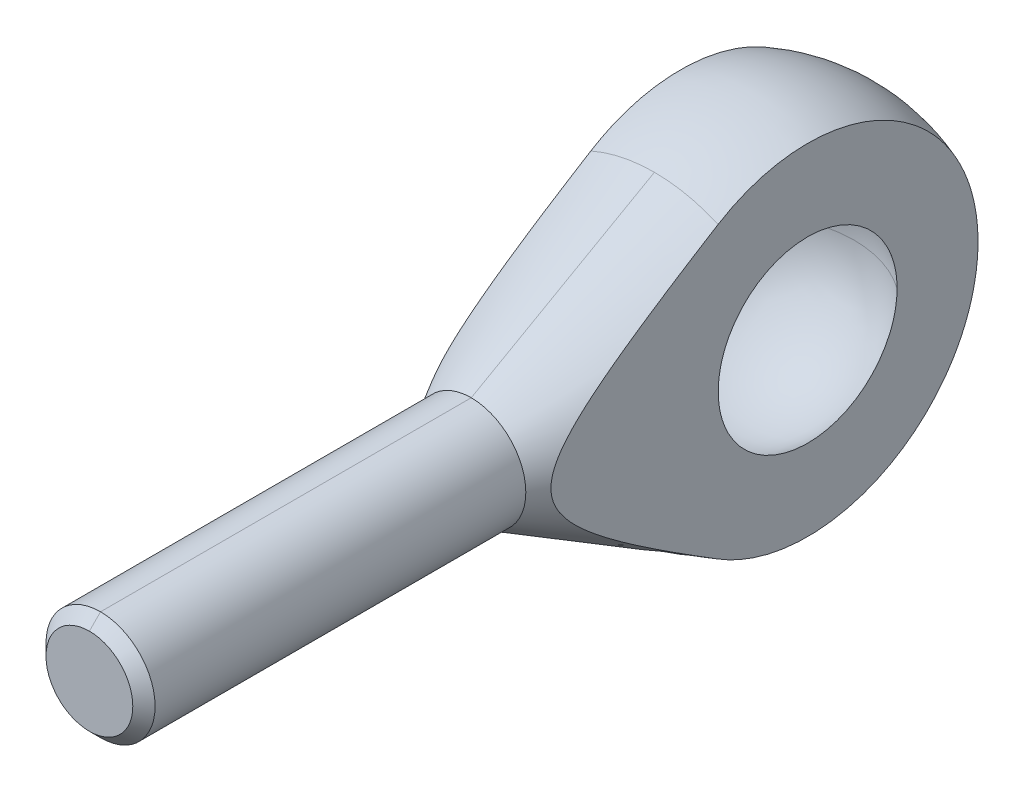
ISO-10303-21;
HEADER;
FILE_DESCRIPTION(('STEP AP214'),'2;1');
FILE_NAME('part.step','',(''),(''),'','','');
FILE_SCHEMA(('AUTOMOTIVE_DESIGN { 1 0 10303 214 1 1 1 1 }'));
ENDSEC;
DATA;
#1=APPLICATION_CONTEXT('core data for automotive mechanical design processes');
#2=APPLICATION_PROTOCOL_DEFINITION('international standard','automotive_design',2000,#1);
#3=PRODUCT_CONTEXT('',#1,'mechanical');
#4=PRODUCT('Part','Part','',(#3));
#5=PRODUCT_RELATED_PRODUCT_CATEGORY('part','',(#4));
#6=PRODUCT_DEFINITION_FORMATION('','',#4);
#7=PRODUCT_DEFINITION_CONTEXT('part definition',#1,'design');
#8=PRODUCT_DEFINITION('design','',#6,#7);
#9=PRODUCT_DEFINITION_SHAPE('','',#8);
#10=(LENGTH_UNIT() NAMED_UNIT(*) SI_UNIT(.MILLI.,.METRE.));
#11=(NAMED_UNIT(*) PLANE_ANGLE_UNIT() SI_UNIT($,.RADIAN.));
#12=(NAMED_UNIT(*) SI_UNIT($,.STERADIAN.) SOLID_ANGLE_UNIT());
#13=UNCERTAINTY_MEASURE_WITH_UNIT(LENGTH_MEASURE(1.E-05),#10,'distance_accuracy_value','');
#14=(GEOMETRIC_REPRESENTATION_CONTEXT(3) GLOBAL_UNCERTAINTY_ASSIGNED_CONTEXT((#13)) GLOBAL_UNIT_ASSIGNED_CONTEXT((#10,
#11,#12)) REPRESENTATION_CONTEXT('',''));
#15=CARTESIAN_POINT('',(0.,0.,0.));
#16=DIRECTION('',(0.,0.,1.));
#17=DIRECTION('',(1.,0.,0.));
#18=AXIS2_PLACEMENT_3D('',#15,#16,#17);
#19=CARTESIAN_POINT('',(0.,1.19325,36.));
#20=DIRECTION('',(0.,0.,1.));
#21=DIRECTION('',(1.,0.,0.));
#22=AXIS2_PLACEMENT_3D('',#19,#20,#21);
#23=PLANE('',#22);
#24=CARTESIAN_POINT('',(0.,0.,35.9999999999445));
#25=DIRECTION('',(0.,0.,-1.));
#26=DIRECTION('',(-1.,0.,0.));
#27=AXIS2_PLACEMENT_3D('',#24,#25,#26);
#28=CIRCLE('',#27,2.38650000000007);
#29=CARTESIAN_POINT('',(0.,2.38650000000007,35.9999999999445));
#30=VERTEX_POINT('',#29);
#31=CARTESIAN_POINT('',(0.,-2.38650000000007,35.9999999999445));
#32=VERTEX_POINT('',#31);
#33=EDGE_CURVE('E76',#30,#32,#28,.T.);
#34=ORIENTED_EDGE('',*,*,#33,.F.);
#35=CARTESIAN_POINT('',(0.,0.,35.9999999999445));
#36=DIRECTION('',(0.,0.,-1.));
#37=DIRECTION('',(-1.,0.,0.));
#38=AXIS2_PLACEMENT_3D('',#35,#36,#37);
#39=CIRCLE('',#38,2.38650000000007);
#40=EDGE_CURVE('E17',#32,#30,#39,.T.);
#41=ORIENTED_EDGE('',*,*,#40,.F.);
#42=EDGE_LOOP('',(#34,#41));
#43=FACE_BOUND('',#42,.T.);
#44=ADVANCED_FACE('F14',(#43),#23,.T.);
#45=CARTESIAN_POINT('',(0.,0.,35.3865000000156));
#46=DIRECTION('',(0.,0.,-1.));
#47=DIRECTION('',(-1.,0.,0.));
#48=AXIS2_PLACEMENT_3D('',#45,#46,#47);
#49=CONICAL_SURFACE('',#48,2.99999999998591,0.785398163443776);
#50=DIRECTION('',(0.,0.707106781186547,0.707106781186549));
#51=VECTOR('',#50,1.);
#52=CARTESIAN_POINT('',(-6.11078570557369E-11,-499000.,-498961.613500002));
#53=LINE('',#52,#51);
#54=CARTESIAN_POINT('',(0.,-2.99999999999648,35.3865000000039));
#55=VERTEX_POINT('',#54);
#56=EDGE_CURVE('E87',#32,#55,#53,.F.);
#57=ORIENTED_EDGE('',*,*,#56,.F.);
#58=ORIENTED_EDGE('',*,*,#40,.T.);
#59=DIRECTION('',(0.,-0.707106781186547,0.707106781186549));
#60=VECTOR('',#59,1.);
#61=CARTESIAN_POINT('',(1.22215714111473E-10,499000.,-498961.613500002));
#62=LINE('',#61,#60);
#63=CARTESIAN_POINT('',(0.,2.99999999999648,35.3865000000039));
#64=VERTEX_POINT('',#63);
#65=EDGE_CURVE('E85',#64,#30,#62,.T.);
#66=ORIENTED_EDGE('',*,*,#65,.F.);
#67=CARTESIAN_POINT('',(0.,0.,35.3865));
#68=DIRECTION('',(0.,0.,1.));
#69=DIRECTION('',(1.,0.,0.));
#70=AXIS2_PLACEMENT_3D('',#67,#68,#69);
#71=CIRCLE('',#70,3.);
#72=EDGE_CURVE('E93',#55,#64,#71,.F.);
#73=ORIENTED_EDGE('',*,*,#72,.F.);
#74=EDGE_LOOP('',(#57,#58,#66,#73));
#75=FACE_BOUND('',#74,.T.);
#76=ADVANCED_FACE('F83',(#75),#49,.T.);
#77=CARTESIAN_POINT('',(0.,0.,35.3865000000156));
#78=DIRECTION('',(0.,0.,-1.));
#79=DIRECTION('',(-1.,0.,0.));
#80=AXIS2_PLACEMENT_3D('',#77,#78,#79);
#81=CONICAL_SURFACE('',#80,2.99999999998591,0.785398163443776);
#82=ORIENTED_EDGE('',*,*,#56,.T.);
#83=CARTESIAN_POINT('',(0.,0.,35.3865));
#84=DIRECTION('',(0.,0.,1.));
#85=DIRECTION('',(1.,0.,0.));
#86=AXIS2_PLACEMENT_3D('',#83,#84,#85);
#87=CIRCLE('',#86,3.);
#88=EDGE_CURVE('E91',#64,#55,#87,.F.);
#89=ORIENTED_EDGE('',*,*,#88,.F.);
#90=ORIENTED_EDGE('',*,*,#65,.T.);
#91=ORIENTED_EDGE('',*,*,#33,.T.);
#92=EDGE_LOOP('',(#82,#89,#90,#91));
#93=FACE_BOUND('',#92,.T.);
#94=ADVANCED_FACE('F89',(#93),#81,.T.);
#95=CARTESIAN_POINT('',(0.,0.,25.19325));
#96=DIRECTION('',(0.,0.,1.));
#97=DIRECTION('',(1.,0.,0.));
#98=AXIS2_PLACEMENT_3D('',#95,#96,#97);
#99=CYLINDRICAL_SURFACE('',#98,3.);
#100=DIRECTION('',(0.,0.,1.));
#101=VECTOR('',#100,1.);
#102=CARTESIAN_POINT('',(0.,-3.,25.19325));
#103=LINE('',#102,#101);
#104=CARTESIAN_POINT('',(0.,-2.99999999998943,14.9999999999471));
#105=VERTEX_POINT('',#104);
#106=EDGE_CURVE('E105',#55,#105,#103,.F.);
#107=ORIENTED_EDGE('',*,*,#106,.F.);
#108=ORIENTED_EDGE('',*,*,#72,.T.);
#109=DIRECTION('',(0.,0.,1.));
#110=VECTOR('',#109,1.);
#111=CARTESIAN_POINT('',(0.,3.,25.19325));
#112=LINE('',#111,#110);
#113=CARTESIAN_POINT('',(0.,2.99999999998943,14.9999999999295));
#114=VERTEX_POINT('',#113);
#115=EDGE_CURVE('E262',#114,#64,#112,.T.);
#116=ORIENTED_EDGE('',*,*,#115,.F.);
#117=CARTESIAN_POINT('',(0.,0.,14.9999999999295));
#118=DIRECTION('',(0.,0.,-1.));
#119=DIRECTION('',(0.,1.,0.));
#120=AXIS2_PLACEMENT_3D('',#117,#118,#119);
#121=CIRCLE('',#120,2.99999999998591);
#122=EDGE_CURVE('E104',#105,#114,#121,.T.);
#123=ORIENTED_EDGE('',*,*,#122,.F.);
#124=EDGE_LOOP('',(#107,#108,#116,#123));
#125=FACE_BOUND('',#124,.T.);
#126=ADVANCED_FACE('F133',(#125),#99,.T.);
#127=CARTESIAN_POINT('',(-3.5,20.,15.));
#128=DIRECTION('',(1.,0.,0.));
#129=DIRECTION('',(0.,0.,-1.));
#130=AXIS2_PLACEMENT_3D('',#127,#128,#129);
#131=PLANE('',#130);
#132=CARTESIAN_POINT('',(-3.5,0.,-9.3674969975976));
#133=CARTESIAN_POINT('',(-3.5,0.263464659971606,-9.36752532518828));
#134=CARTESIAN_POINT('',(-3.5,0.526925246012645,-9.35638311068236));
#135=CARTESIAN_POINT('',(-3.5,1.0519615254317,-9.31196219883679));
#136=CARTESIAN_POINT('',(-3.5,1.31353730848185,-9.27868456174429));
#137=CARTESIAN_POINT('',(-3.5,1.83276860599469,-9.19022875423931));
#138=CARTESIAN_POINT('',(-3.5,2.09042676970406,-9.13506613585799));
#139=CARTESIAN_POINT('',(-3.5,2.60017972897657,-9.00324168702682));
#140=CARTESIAN_POINT('',(-3.5,2.85227459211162,-8.92658011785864));
#141=CARTESIAN_POINT('',(-3.5,3.3492280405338,-8.75225935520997));
#142=CARTESIAN_POINT('',(-3.5,3.59408322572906,-8.65459046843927));
#143=CARTESIAN_POINT('',(-3.5,4.07469958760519,-8.43896884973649));
#144=CARTESIAN_POINT('',(-3.5,4.3104605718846,-8.32101568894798));
#145=CARTESIAN_POINT('',(-3.5,4.77115998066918,-8.06569136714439));
#146=CARTESIAN_POINT('',(-3.5,4.99610058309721,-7.92832413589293));
#147=CARTESIAN_POINT('',(-3.5,5.43361031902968,-7.63513083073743));
#148=CARTESIAN_POINT('',(-3.5,5.64617950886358,-7.47930484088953));
#149=CARTESIAN_POINT('',(-3.5,6.05744099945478,-7.15029758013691));
#150=CARTESIAN_POINT('',(-3.5,6.2561330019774,-6.97711593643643));
#151=CARTESIAN_POINT('',(-3.5,6.63822268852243,-6.6146312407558));
#152=CARTESIAN_POINT('',(-3.5,6.82162037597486,-6.42532819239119));
#153=CARTESIAN_POINT('',(-3.5,7.17184519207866,-6.03191553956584));
#154=CARTESIAN_POINT('',(-3.5,7.3386697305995,-5.82780362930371));
#155=CARTESIAN_POINT('',(-3.5,7.65452942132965,-5.4062508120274));
#156=CARTESIAN_POINT('',(-3.5,7.80356458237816,-5.18880991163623));
#157=CARTESIAN_POINT('',(-3.5,8.0827832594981,-4.74214936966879));
#158=CARTESIAN_POINT('',(-3.5,8.21296713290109,-4.51292995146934));
#159=CARTESIAN_POINT('',(-3.5,8.45356095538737,-4.04433839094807));
#160=CARTESIAN_POINT('',(-3.5,8.5639709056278,-3.80496624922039));
#161=CARTESIAN_POINT('',(-3.5,8.76422020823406,-3.31779955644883));
#162=CARTESIAN_POINT('',(-3.5,8.85406194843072,-3.07000598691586));
#163=CARTESIAN_POINT('',(-3.5,9.0125524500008,-2.56773202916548));
#164=CARTESIAN_POINT('',(-3.5,9.08120125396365,-2.31325165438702));
#165=CARTESIAN_POINT('',(-3.5,9.19681132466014,-1.79944286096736));
#166=CARTESIAN_POINT('',(-3.5,9.24377514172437,-1.5401150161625));
#167=CARTESIAN_POINT('',(-3.5,9.31569340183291,-1.01842507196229));
#168=CARTESIAN_POINT('',(-3.5,9.34064783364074,-0.756062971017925));
#169=CARTESIAN_POINT('',(-3.5,9.36837506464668,-0.230072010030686));
#170=CARTESIAN_POINT('',(-3.5,9.37113966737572,0.0335572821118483));
#171=CARTESIAN_POINT('',(-3.5,9.35444623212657,0.560103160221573));
#172=CARTESIAN_POINT('',(-3.5,9.33498888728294,0.823019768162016));
#173=CARTESIAN_POINT('',(-3.5,9.27397152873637,1.34644843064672));
#174=CARTESIAN_POINT('',(-3.5,9.23239715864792,1.60695881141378));
#175=CARTESIAN_POINT('',(-3.5,9.12743310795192,2.1235415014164));
#176=CARTESIAN_POINT('',(-3.5,9.06404402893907,2.3796139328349));
#177=CARTESIAN_POINT('',(-3.5,8.91600479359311,2.88515998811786));
#178=CARTESIAN_POINT('',(-3.5,8.83138300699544,3.13464193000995));
#179=CARTESIAN_POINT('',(-3.5,8.64146852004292,3.62549560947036));
#180=CARTESIAN_POINT('',(-3.5,8.53618623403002,3.86687136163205));
#181=CARTESIAN_POINT('',(-3.5,8.35228457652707,4.24428303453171));
#182=CARTESIAN_POINT('',(-3.5,8.2800769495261,4.38348015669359));
#183=CARTESIAN_POINT('',(-3.5,8.12889166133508,4.65785542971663));
#184=CARTESIAN_POINT('',(-3.5,8.04992510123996,4.79303969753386));
#185=CARTESIAN_POINT('',(-3.5,7.96760957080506,4.92617475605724));
#186=B_SPLINE_CURVE_WITH_KNOTS('',3,(#132,#133,#134,#135,#136,#137,#138,#139,#140,#141,#142,
#143,#144,#145,#146,#147,#148,#149,#150,#151,#152,#153,#154,#155,#156,#157,#158,#159,#160,#161,
#162,#163,#164,#165,#166,#167,#168,#169,#170,#171,#172,#173,#174,#175,#176,#177,#178,#179,#180,
#181,#182,#183,#184,#185),.UNSPECIFIED.,.F.,.F.,(4,2,2,2,2,2,2,2,2,2,2,2,2,2,2,2,2,2,2,2,2,2,2,
2,2,2,4),(0.,0.790152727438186,1.58026761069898,2.36982202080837,3.15936683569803,
3.94927675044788,4.73920336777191,5.52897031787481,6.31873367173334,7.1085139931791,
7.89829413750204,8.68819751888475,9.47810050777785,10.267988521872,11.0578764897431,
11.8476727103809,12.6374673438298,13.427169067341,14.2168711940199,15.0068650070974,
15.796834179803,16.5873167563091,17.3777775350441,18.167187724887,18.9562010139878,
19.4264555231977,19.8959519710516),.UNSPECIFIED.);
#187=CARTESIAN_POINT('',(-3.5,0.,-9.3674969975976));
#188=VERTEX_POINT('',#187);
#189=CARTESIAN_POINT('',(-3.5,7.96760957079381,4.92617475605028));
#190=VERTEX_POINT('',#189);
#191=EDGE_CURVE('E313',#188,#190,#186,.T.);
#192=ORIENTED_EDGE('',*,*,#191,.F.);
#193=CARTESIAN_POINT('',(-3.5,-7.96760957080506,4.92617475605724));
#194=CARTESIAN_POINT('',(-3.5,-8.10618433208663,4.70209739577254));
#195=CARTESIAN_POINT('',(-3.5,-8.23525574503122,4.4721491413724));
#196=CARTESIAN_POINT('',(-3.5,-8.4735789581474,4.00221472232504));
#197=CARTESIAN_POINT('',(-3.5,-8.58283170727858,3.76222903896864));
#198=CARTESIAN_POINT('',(-3.5,-8.7806479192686,3.27407505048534));
#199=CARTESIAN_POINT('',(-3.5,-8.86922600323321,3.02591267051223));
#200=CARTESIAN_POINT('',(-3.5,-9.02517015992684,2.52301388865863));
#201=CARTESIAN_POINT('',(-3.5,-9.09253649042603,2.26827756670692));
#202=CARTESIAN_POINT('',(-3.5,-9.20560402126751,1.75391758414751));
#203=CARTESIAN_POINT('',(-3.5,-9.25129518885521,1.49429171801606));
#204=CARTESIAN_POINT('',(-3.5,-9.32064256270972,0.972108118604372));
#205=CARTESIAN_POINT('',(-3.5,-9.34429830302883,0.709550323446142));
#206=CARTESIAN_POINT('',(-3.5,-9.36940226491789,0.183428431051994));
#207=CARTESIAN_POINT('',(-3.5,-9.37085497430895,-0.0801354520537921));
#208=CARTESIAN_POINT('',(-3.5,-9.35155415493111,-0.606447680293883));
#209=CARTESIAN_POINT('',(-3.5,-9.33080072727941,-0.869196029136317));
#210=CARTESIAN_POINT('',(-3.5,-9.2672346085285,-1.39201639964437));
#211=CARTESIAN_POINT('',(-3.5,-9.22442144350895,-1.65208836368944));
#212=CARTESIAN_POINT('',(-3.5,-9.11703993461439,-2.16770148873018));
#213=CARTESIAN_POINT('',(-3.5,-9.05247159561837,-2.42324265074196));
#214=CARTESIAN_POINT('',(-3.5,-8.90202694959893,-2.92801720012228));
#215=CARTESIAN_POINT('',(-3.5,-8.81614731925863,-3.17724959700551));
#216=CARTESIAN_POINT('',(-3.5,-8.62369588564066,-3.6675929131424));
#217=CARTESIAN_POINT('',(-3.5,-8.51712409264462,-3.90870383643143));
#218=CARTESIAN_POINT('',(-3.5,-8.28404829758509,-4.38108544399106));
#219=CARTESIAN_POINT('',(-3.5,-8.15754467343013,-4.61235631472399));
#220=CARTESIAN_POINT('',(-3.5,-7.88550323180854,-5.06341827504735));
#221=CARTESIAN_POINT('',(-3.5,-7.73996541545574,-5.28320936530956));
#222=CARTESIAN_POINT('',(-3.5,-7.43090837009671,-5.70972420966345));
#223=CARTESIAN_POINT('',(-3.5,-7.26739123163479,-5.91644947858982));
#224=CARTESIAN_POINT('',(-3.5,-6.9235244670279,-6.31539059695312));
#225=CARTESIAN_POINT('',(-3.5,-6.74317487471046,-6.5076064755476));
#226=CARTESIAN_POINT('',(-3.5,-6.36694711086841,-6.87614118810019));
#227=CARTESIAN_POINT('',(-3.5,-6.17107076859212,-7.05246188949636));
#228=CARTESIAN_POINT('',(-3.5,-5.76516299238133,-7.38797867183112));
#229=CARTESIAN_POINT('',(-3.5,-5.55513155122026,-7.547174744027));
#230=CARTESIAN_POINT('',(-3.5,-5.12232634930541,-7.84736626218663));
#231=CARTESIAN_POINT('',(-3.5,-4.89954791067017,-7.98835496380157));
#232=CARTESIAN_POINT('',(-3.5,-4.44291080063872,-8.25105590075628));
#233=CARTESIAN_POINT('',(-3.5,-4.20905247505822,-8.37276873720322));
#234=CARTESIAN_POINT('',(-3.5,-3.73175769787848,-8.59613027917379));
#235=CARTESIAN_POINT('',(-3.5,-3.48831512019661,-8.69776589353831));
#236=CARTESIAN_POINT('',(-3.5,-2.99373258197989,-8.88014802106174));
#237=CARTESIAN_POINT('',(-3.5,-2.74259283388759,-8.96089511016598));
#238=CARTESIAN_POINT('',(-3.5,-2.23474524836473,-9.10083530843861));
#239=CARTESIAN_POINT('',(-3.5,-1.97804525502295,-9.16005692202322));
#240=CARTESIAN_POINT('',(-3.5,-1.46067306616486,-9.25665332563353));
#241=CARTESIAN_POINT('',(-3.5,-1.20000293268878,-9.29403908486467));
#242=CARTESIAN_POINT('',(-3.5,-0.782281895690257,-9.33609292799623));
#243=CARTESIAN_POINT('',(-3.5,-0.625914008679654,-9.34787699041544));
#244=CARTESIAN_POINT('',(-3.5,-0.313036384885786,-9.36357330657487));
#245=CARTESIAN_POINT('',(-3.5,-0.156527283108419,-9.36749821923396));
#246=CARTESIAN_POINT('',(-3.5,0.,-9.36749699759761));
#247=B_SPLINE_CURVE_WITH_KNOTS('',3,(#193,#194,#195,#196,#197,#198,#199,#200,#201,#202,#203,
#204,#205,#206,#207,#208,#209,#210,#211,#212,#213,#214,#215,#216,#217,#218,#219,#220,#221,#222,
#223,#224,#225,#226,#227,#228,#229,#230,#231,#232,#233,#234,#235,#236,#237,#238,#239,#240,#241,
#242,#243,#244,#245,#246),.UNSPECIFIED.,.F.,.F.,(4,2,2,2,2,2,2,2,2,2,2,2,2,2,2,2,2,2,2,2,2,2,2,
2,2,2,4),(0.,0.790152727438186,1.58026761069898,2.36982202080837,3.15936683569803,
3.94927675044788,4.73920336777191,5.52897031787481,6.31873367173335,7.1085139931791,
7.89829413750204,8.68819751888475,9.47810050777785,10.267988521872,11.0578764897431,
11.8476727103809,12.6374673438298,13.427169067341,14.21687119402,15.0068650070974,
15.796834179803,16.5873167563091,17.3777775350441,18.167187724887,18.9562010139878,
19.4264555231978,19.8959519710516),.UNSPECIFIED.);
#248=CARTESIAN_POINT('',(-3.5,-7.96760957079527,4.92617475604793));
#249=VERTEX_POINT('',#248);
#250=EDGE_CURVE('E244',#249,#188,#247,.T.);
#251=ORIENTED_EDGE('',*,*,#250,.F.);
#252=CARTESIAN_POINT('',(-3.5,7.96760957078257,4.92617475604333));
#253=CARTESIAN_POINT('',(-3.5,7.84386145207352,5.12631978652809));
#254=CARTESIAN_POINT('',(-3.5,7.7197811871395,5.32625964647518));
#255=CARTESIAN_POINT('',(-3.5,7.47084585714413,5.72565904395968));
#256=CARTESIAN_POINT('',(-3.5,7.34599078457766,5.92511857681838));
#257=CARTESIAN_POINT('',(-3.5,6.97000497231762,6.52281886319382));
#258=CARTESIAN_POINT('',(-3.5,6.7175485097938,6.92022748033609));
#259=CARTESIAN_POINT('',(-3.5,6.20853239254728,7.71095230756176));
#260=CARTESIAN_POINT('',(-3.5,5.95198519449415,8.10427650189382));
#261=CARTESIAN_POINT('',(-3.5,5.5621651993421,8.69087944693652));
#262=CARTESIAN_POINT('',(-3.5,5.4314068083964,8.88582839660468));
#263=CARTESIAN_POINT('',(-3.5,5.16785097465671,9.27434199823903));
#264=CARTESIAN_POINT('',(-3.5,5.03505355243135,9.46790666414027));
#265=CARTESIAN_POINT('',(-3.5,4.71432757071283,9.92899904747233));
#266=CARTESIAN_POINT('',(-3.5,4.52523116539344,10.1957170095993));
#267=CARTESIAN_POINT('',(-3.5,4.14041703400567,10.7245719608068));
#268=CARTESIAN_POINT('',(-3.5,3.94469618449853,10.9867066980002));
#269=CARTESIAN_POINT('',(-3.5,3.6433981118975,11.3755207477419));
#270=CARTESIAN_POINT('',(-3.5,3.54127729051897,11.5048760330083));
#271=CARTESIAN_POINT('',(-3.5,3.33416640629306,11.7612639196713));
#272=CARTESIAN_POINT('',(-3.5,3.22917652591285,11.8882966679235));
#273=CARTESIAN_POINT('',(-3.5,3.01576691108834,12.1392734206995));
#274=CARTESIAN_POINT('',(-3.5,2.90735018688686,12.2632199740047));
#275=CARTESIAN_POINT('',(-3.5,2.68616175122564,12.5071472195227));
#276=CARTESIAN_POINT('',(-3.5,2.57339085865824,12.6271286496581));
#277=CARTESIAN_POINT('',(-3.5,2.34030688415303,12.863773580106));
#278=CARTESIAN_POINT('',(-3.5,2.21989600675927,12.9803415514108));
#279=CARTESIAN_POINT('',(-3.5,1.97159489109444,13.2056961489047));
#280=CARTESIAN_POINT('',(-3.5,1.84369487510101,13.3144721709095));
#281=CARTESIAN_POINT('',(-3.5,1.58023792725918,13.5189119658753));
#282=CARTESIAN_POINT('',(-3.5,1.44479653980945,13.614722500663));
#283=CARTESIAN_POINT('',(-3.5,1.16297199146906,13.7884640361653));
#284=CARTESIAN_POINT('',(-3.5,1.01662649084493,13.8664531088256));
#285=CARTESIAN_POINT('',(-3.5,0.803191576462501,13.9568652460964));
#286=CARTESIAN_POINT('',(-3.5,0.740890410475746,13.9806509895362));
#287=CARTESIAN_POINT('',(-3.5,0.614538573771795,14.0230830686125));
#288=CARTESIAN_POINT('',(-3.5,0.550487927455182,14.0417294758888));
#289=CARTESIAN_POINT('',(-3.5,0.421063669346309,14.073156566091));
#290=CARTESIAN_POINT('',(-3.5,0.355692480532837,14.0859471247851));
#291=CARTESIAN_POINT('',(-3.5,0.224021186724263,14.1051434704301));
#292=CARTESIAN_POINT('',(-3.5,0.157721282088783,14.1115506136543));
#293=CARTESIAN_POINT('',(-3.5,0.0243918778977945,14.1176897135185));
#294=CARTESIAN_POINT('',(-3.5,-0.0426395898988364,14.1173795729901));
#295=CARTESIAN_POINT('',(-3.5,-0.176324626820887,14.109996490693));
#296=CARTESIAN_POINT('',(-3.5,-0.242978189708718,14.1029234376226));
#297=CARTESIAN_POINT('',(-3.5,-0.375377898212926,14.0823466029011));
#298=CARTESIAN_POINT('',(-3.5,-0.441122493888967,14.0688329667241));
#299=CARTESIAN_POINT('',(-3.5,-0.571141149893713,14.035962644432));
#300=CARTESIAN_POINT('',(-3.5,-0.635414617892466,14.0166036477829));
#301=CARTESIAN_POINT('',(-3.5,-0.780908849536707,13.9662799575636));
#302=CARTESIAN_POINT('',(-3.5,-0.861526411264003,13.9335762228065));
#303=CARTESIAN_POINT('',(-3.5,-1.01952781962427,13.8611451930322));
#304=CARTESIAN_POINT('',(-3.5,-1.09691022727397,13.8214148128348));
#305=CARTESIAN_POINT('',(-3.5,-1.24871283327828,13.7362178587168));
#306=CARTESIAN_POINT('',(-3.5,-1.32312386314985,13.6907351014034));
#307=CARTESIAN_POINT('',(-3.5,-1.46896006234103,13.595284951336));
#308=CARTESIAN_POINT('',(-3.5,-1.54038586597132,13.5453185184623));
#309=CARTESIAN_POINT('',(-3.5,-1.71790665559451,13.4142375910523));
#310=CARTESIAN_POINT('',(-3.5,-1.82221098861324,13.3307043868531));
#311=CARTESIAN_POINT('',(-3.5,-2.02567651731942,13.1575542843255));
#312=CARTESIAN_POINT('',(-3.5,-2.12483441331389,13.0679335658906));
#313=CARTESIAN_POINT('',(-3.5,-2.31907899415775,12.884023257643));
#314=CARTESIAN_POINT('',(-3.5,-2.41415697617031,12.7897245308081));
#315=CARTESIAN_POINT('',(-3.5,-2.60079535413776,12.5977031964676));
#316=CARTESIAN_POINT('',(-3.5,-2.69235526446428,12.4999801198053));
#317=CARTESIAN_POINT('',(-3.5,-2.87348005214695,12.3008624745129));
#318=CARTESIAN_POINT('',(-3.5,-2.96301461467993,12.1994404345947));
#319=CARTESIAN_POINT('',(-3.5,-3.1395921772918,11.9944498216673));
#320=CARTESIAN_POINT('',(-3.5,-3.22663506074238,11.8908811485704));
#321=CARTESIAN_POINT('',(-3.5,-3.48439238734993,11.5778955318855));
#322=CARTESIAN_POINT('',(-3.5,-3.65199016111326,11.3659137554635));
#323=CARTESIAN_POINT('',(-3.5,-4.01152260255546,10.8977945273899));
#324=CARTESIAN_POINT('',(-3.5,-4.20223878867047,10.6407295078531));
#325=CARTESIAN_POINT('',(-3.5,-4.57762326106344,10.122198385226));
#326=CARTESIAN_POINT('',(-3.5,-4.7622908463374,9.86073177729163));
#327=CARTESIAN_POINT('',(-3.5,-5.12729603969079,9.33442068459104));
#328=CARTESIAN_POINT('',(-3.5,-5.3076291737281,9.06957310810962));
#329=CARTESIAN_POINT('',(-3.5,-5.66484653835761,8.53756065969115));
#330=CARTESIAN_POINT('',(-3.5,-5.8417307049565,8.27039574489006));
#331=CARTESIAN_POINT('',(-3.5,-6.18370574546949,7.74818290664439));
#332=CARTESIAN_POINT('',(-3.5,-6.348932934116,7.49322408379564));
#333=CARTESIAN_POINT('',(-3.5,-6.67742806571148,6.98204265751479));
#334=CARTESIAN_POINT('',(-3.5,-6.84069597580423,6.72582003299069));
#335=CARTESIAN_POINT('',(-3.5,-7.16533172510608,6.21282816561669));
#336=CARTESIAN_POINT('',(-3.5,-7.32670248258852,5.95606076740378));
#337=CARTESIAN_POINT('',(-3.5,-7.64809874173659,5.44169784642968));
#338=CARTESIAN_POINT('',(-3.5,-7.8081242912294,5.18410235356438));
#339=CARTESIAN_POINT('',(-3.5,-7.96760957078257,4.92617475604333));
#340=B_SPLINE_CURVE_WITH_KNOTS('',3,(#252,#253,#254,#255,#256,#257,#258,#259,#260,#261,#262,
#263,#264,#265,#266,#267,#268,#269,#270,#271,#272,#273,#274,#275,#276,#277,#278,#279,#280,#281,
#282,#283,#284,#285,#286,#287,#288,#289,#290,#291,#292,#293,#294,#295,#296,#297,#298,#299,#300,
#301,#302,#303,#304,#305,#306,#307,#308,#309,#310,#311,#312,#313,#314,#315,#316,#317,#318,#319,
#320,#321,#322,#323,#324,#325,#326,#327,#328,#329,#330,#331,#332,#333,#334,#335,#336,#337,#338,
#339),.UNSPECIFIED.,.F.,.F.,(4,2,2,2,2,2,2,2,2,2,2,2,2,2,2,2,2,2,2,2,2,2,2,2,2,2,2,2,2,2,2,2,2,
2,2,2,2,2,2,2,2,2,2,4),(0.,0.705935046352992,1.41187694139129,2.82430289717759,4.2330352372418,
4.93724492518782,5.64144751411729,6.62223376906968,7.60348909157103,8.09787974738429,
8.59223903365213,9.08617551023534,9.58001953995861,10.0825531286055,10.5857581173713,
11.0826800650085,11.5779589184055,11.7778404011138,11.9777190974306,12.1772594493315,
12.376757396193,12.5775059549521,12.7782578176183,12.9793178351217,13.1804574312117,
13.4410218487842,13.7017009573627,13.9631304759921,14.2245041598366,14.6250514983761,
15.0258525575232,15.4274698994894,15.8291424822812,16.2349577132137,16.6407919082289,
17.4513141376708,18.4114547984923,19.3717063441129,20.3329098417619,21.2941311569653,
22.2055678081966,23.117019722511,24.0268121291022,24.9365720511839),.UNSPECIFIED.);
#341=EDGE_CURVE('E96',#190,#249,#340,.T.);
#342=ORIENTED_EDGE('',*,*,#341,.F.);
#343=EDGE_LOOP('',(#192,#251,#342));
#344=FACE_BOUND('',#343,.T.);
#345=CARTESIAN_POINT('',(-3.5,0.,-4.91642400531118));
#346=CARTESIAN_POINT('',(-3.5,0.13827597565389,-4.91643887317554));
#347=CARTESIAN_POINT('',(-3.5,0.276549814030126,-4.91059104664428));
#348=CARTESIAN_POINT('',(-3.5,0.552108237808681,-4.88727738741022));
#349=CARTESIAN_POINT('',(-3.5,0.689392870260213,-4.86981211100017));
#350=CARTESIAN_POINT('',(-3.5,0.961905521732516,-4.8233872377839));
#351=CARTESIAN_POINT('',(-3.5,1.0971349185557,-4.79443572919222));
#352=CARTESIAN_POINT('',(-3.5,1.36467383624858,-4.72524901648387));
#353=CARTESIAN_POINT('',(-3.5,1.49698339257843,-4.68501394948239));
#354=CARTESIAN_POINT('',(-3.5,1.75778161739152,-4.59353145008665));
#355=CARTESIAN_POINT('',(-3.5,1.88626918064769,-4.54228086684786));
#356=CARTESIAN_POINT('',(-3.5,2.13851721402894,-4.42911782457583));
#357=CARTESIAN_POINT('',(-3.5,2.26227592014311,-4.36720143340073));
#358=CARTESIAN_POINT('',(-3.5,2.50406719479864,-4.23319816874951));
#359=CARTESIAN_POINT('',(-3.5,2.62210296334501,-4.16111706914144));
#360=CARTESIAN_POINT('',(-3.5,2.85172703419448,-4.00724171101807));
#361=CARTESIAN_POINT('',(-3.5,2.96331294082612,-3.92544387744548));
#362=CARTESIAN_POINT('',(-3.5,3.17915908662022,-3.75276798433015));
#363=CARTESIAN_POINT('',(-3.5,3.28342185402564,-3.66189308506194));
#364=CARTESIAN_POINT('',(-3.5,3.48396051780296,-3.47164992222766));
#365=CARTESIAN_POINT('',(-3.5,3.58023345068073,-3.37227853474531));
#366=CARTESIAN_POINT('',(-3.5,3.76404488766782,-3.16580036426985));
#367=CARTESIAN_POINT('',(-3.5,3.85158527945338,-3.05869526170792));
#368=CARTESIAN_POINT('',(-3.5,4.01736379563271,-2.83745097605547));
#369=CARTESIAN_POINT('',(-3.5,4.09559847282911,-2.72330920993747));
#370=CARTESIAN_POINT('',(-3.5,4.24214118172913,-2.4888877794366));
#371=CARTESIAN_POINT('',(-3.5,4.31045330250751,-2.36861067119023));
#372=CARTESIAN_POINT('',(-3.5,4.43672724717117,-2.1226845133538));
#373=CARTESIAN_POINT('',(-3.5,4.49468524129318,-1.99703349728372));
#374=CARTESIAN_POINT('',(-3.5,4.59978493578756,-1.7413501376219));
#375=CARTESIAN_POINT('',(-3.5,4.64693130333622,-1.61131971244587));
#376=CARTESIAN_POINT('',(-3.5,4.7301201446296,-1.34770143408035));
#377=CARTESIAN_POINT('',(-3.5,4.76615852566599,-1.21411228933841));
#378=CARTESIAN_POINT('',(-3.5,4.82684133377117,-0.944418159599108));
#379=CARTESIAN_POINT('',(-3.5,4.8514895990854,-0.808314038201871));
#380=CARTESIAN_POINT('',(-3.5,4.88924151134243,-0.534465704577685));
#381=CARTESIAN_POINT('',(-3.5,4.90234114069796,-0.396720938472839));
#382=CARTESIAN_POINT('',(-3.5,4.91688690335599,-0.120638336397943));
#383=CARTESIAN_POINT('',(-3.5,4.91833479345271,0.0176994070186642));
#384=CARTESIAN_POINT('',(-3.5,4.90957140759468,0.29400510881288));
#385=CARTESIAN_POINT('',(-3.5,4.89936013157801,0.431973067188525));
#386=CARTESIAN_POINT('',(-3.5,4.86734837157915,0.706580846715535));
#387=CARTESIAN_POINT('',(-3.5,4.84554598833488,0.843220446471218));
#388=CARTESIAN_POINT('',(-3.5,4.79051549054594,1.11412959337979));
#389=CARTESIAN_POINT('',(-3.5,4.75729135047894,1.24839994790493));
#390=CARTESIAN_POINT('',(-3.5,4.67963803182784,1.51371225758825));
#391=CARTESIAN_POINT('',(-3.5,4.63520488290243,1.64475305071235));
#392=CARTESIAN_POINT('',(-3.5,4.53547379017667,1.90257730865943));
#393=CARTESIAN_POINT('',(-3.5,4.48017984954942,2.02936232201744));
#394=CARTESIAN_POINT('',(-3.5,4.35908581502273,2.27787374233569));
#395=CARTESIAN_POINT('',(-3.5,4.29328158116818,2.39959813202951));
#396=CARTESIAN_POINT('',(-3.5,4.15167682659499,2.63702548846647));
#397=CARTESIAN_POINT('',(-3.5,4.07588000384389,2.75273066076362));
#398=CARTESIAN_POINT('',(-3.5,3.91478417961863,2.9773815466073));
#399=CARTESIAN_POINT('',(-3.5,3.82948214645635,3.08632508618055));
#400=CARTESIAN_POINT('',(-3.5,3.65003546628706,3.29659871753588));
#401=CARTESIAN_POINT('',(-3.5,3.55589409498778,3.39793160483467));
#402=CARTESIAN_POINT('',(-3.5,3.35938802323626,3.59233113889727));
#403=CARTESIAN_POINT('',(-3.5,3.25702139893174,3.68539584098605));
#404=CARTESIAN_POINT('',(-3.5,3.04485109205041,3.86253785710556));
#405=CARTESIAN_POINT('',(-3.5,2.93505016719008,3.94661847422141));
#406=CARTESIAN_POINT('',(-3.5,2.70867972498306,4.10528893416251));
#407=CARTESIAN_POINT('',(-3.5,2.59210560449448,4.17987220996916));
#408=CARTESIAN_POINT('',(-3.5,2.35313096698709,4.31892389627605));
#409=CARTESIAN_POINT('',(-3.5,2.2307326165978,4.38339603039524));
#410=CARTESIAN_POINT('',(-3.5,1.98081731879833,4.50185844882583));
#411=CARTESIAN_POINT('',(-3.5,1.8532954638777,4.55583837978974));
#412=CARTESIAN_POINT('',(-3.5,1.59420200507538,4.65283477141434));
#413=CARTESIAN_POINT('',(-3.5,1.46263194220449,4.69585534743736));
#414=CARTESIAN_POINT('',(-3.5,1.19648421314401,4.77061185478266));
#415=CARTESIAN_POINT('',(-3.5,1.06191002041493,4.80236016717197));
#416=CARTESIAN_POINT('',(-3.5,0.790619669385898,4.854400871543));
#417=CARTESIAN_POINT('',(-3.5,0.653904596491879,4.87469888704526));
#418=CARTESIAN_POINT('',(-3.5,0.430743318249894,4.89827965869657));
#419=CARTESIAN_POINT('',(-3.5,0.344654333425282,4.90508812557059));
#420=CARTESIAN_POINT('',(-3.5,0.172379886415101,4.91415704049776));
#421=CARTESIAN_POINT('',(-3.5,0.0861948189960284,4.91642498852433));
#422=CARTESIAN_POINT('',(-3.5,-4.58400678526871E-13,4.91642400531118));
#423=B_SPLINE_CURVE_WITH_KNOTS('',3,(#345,#346,#347,#348,#349,#350,#351,#352,#353,#354,#355,
#356,#357,#358,#359,#360,#361,#362,#363,#364,#365,#366,#367,#368,#369,#370,#371,#372,#373,#374,
#375,#376,#377,#378,#379,#380,#381,#382,#383,#384,#385,#386,#387,#388,#389,#390,#391,#392,#393,
#394,#395,#396,#397,#398,#399,#400,#401,#402,#403,#404,#405,#406,#407,#408,#409,#410,#411,#412,
#413,#414,#415,#416,#417,#418,#419,#420,#421,#422),.UNSPECIFIED.,.F.,.F.,(4,2,2,2,2,2,2,2,2,2,2,
2,2,2,2,2,2,2,2,2,2,2,2,2,2,2,2,2,2,2,2,2,2,2,2,2,2,2,4),(0.,0.41470131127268,0.829382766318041,
1.2437727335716,1.65815766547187,2.07266128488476,2.48731804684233,2.90174021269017,
3.31631533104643,3.73074661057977,4.14533092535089,4.55982542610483,4.97447299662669,
5.38894920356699,5.80357840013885,6.21802827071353,6.63263066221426,7.04709323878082,
7.46169994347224,7.87624413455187,8.29078832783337,8.7054004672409,9.11986847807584,
9.53448350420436,9.94894599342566,10.3635721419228,10.7780452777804,11.1926509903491,
11.6071036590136,12.0216535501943,12.4360504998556,12.8507324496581,13.2652613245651,
13.6801971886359,14.0949770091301,14.5092998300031,14.9234189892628,15.1823823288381,
15.4409175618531),.UNSPECIFIED.);
#424=CARTESIAN_POINT('',(-3.5,0.,-4.91642400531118));
#425=VERTEX_POINT('',#424);
#426=CARTESIAN_POINT('',(-3.5,-1.60232804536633E-12,4.91642400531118));
#427=VERTEX_POINT('',#426);
#428=EDGE_CURVE('E333',#425,#427,#423,.T.);
#429=ORIENTED_EDGE('',*,*,#428,.T.);
#430=CARTESIAN_POINT('',(-3.5,-4.58400678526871E-13,4.91642400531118));
#431=CARTESIAN_POINT('',(-3.5,-0.138279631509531,4.91643887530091));
#432=CARTESIAN_POINT('',(-3.5,-0.276557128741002,4.91059073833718));
#433=CARTESIAN_POINT('',(-3.5,-0.552122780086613,4.88727584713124));
#434=CARTESIAN_POINT('',(-3.5,-0.689410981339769,4.86980965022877));
#435=CARTESIAN_POINT('',(-3.5,-0.961923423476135,4.82338356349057));
#436=CARTESIAN_POINT('',(-3.5,-1.09714914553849,4.79443236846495));
#437=CARTESIAN_POINT('',(-3.5,-1.36468083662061,4.7252468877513));
#438=CARTESIAN_POINT('',(-3.5,-1.49698684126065,4.6850127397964));
#439=CARTESIAN_POINT('',(-3.5,-1.75778028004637,4.59353191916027));
#440=CARTESIAN_POINT('',(-3.5,-1.88626654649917,4.54228191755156));
#441=CARTESIAN_POINT('',(-3.5,-2.13851211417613,4.4291202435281));
#442=CARTESIAN_POINT('',(-3.5,-2.26226965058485,4.36720463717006));
#443=CARTESIAN_POINT('',(-3.5,-2.50406121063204,4.23320175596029));
#444=CARTESIAN_POINT('',(-3.5,-2.62209831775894,4.16112004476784));
#445=CARTESIAN_POINT('',(-3.5,-2.85172485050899,4.00724331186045));
#446=CARTESIAN_POINT('',(-3.5,-2.96331188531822,3.92544472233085));
#447=CARTESIAN_POINT('',(-3.5,-3.17915656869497,3.75276999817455));
#448=CARTESIAN_POINT('',(-3.5,-3.2834169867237,3.66189732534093));
#449=CARTESIAN_POINT('',(-3.5,-3.48395166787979,3.47165869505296));
#450=CARTESIAN_POINT('',(-3.5,-3.58022294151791,3.37228958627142));
#451=CARTESIAN_POINT('',(-3.5,-3.76403591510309,3.16581119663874));
#452=CARTESIAN_POINT('',(-3.5,-3.85157907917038,3.05870321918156));
#453=CARTESIAN_POINT('',(-3.5,-4.01736146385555,2.83745440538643));
#454=CARTESIAN_POINT('',(-3.5,-4.09559736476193,2.72331108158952));
#455=CARTESIAN_POINT('',(-3.5,-4.24217375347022,2.48883557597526));
#456=CARTESIAN_POINT('',(-3.5,-4.31051408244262,2.36850329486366));
#457=CARTESIAN_POINT('',(-3.5,-4.43681183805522,2.1225087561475));
#458=CARTESIAN_POINT('',(-3.5,-4.49476922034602,1.99684647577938));
#459=CARTESIAN_POINT('',(-3.5,-4.59986366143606,1.74114131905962));
#460=CARTESIAN_POINT('',(-3.5,-4.64700591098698,1.61110057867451));
#461=CARTESIAN_POINT('',(-3.5,-4.7301597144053,1.34755871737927));
#462=CARTESIAN_POINT('',(-3.5,-4.76617369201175,1.21405835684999));
#463=CARTESIAN_POINT('',(-3.5,-4.83633669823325,0.902199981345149));
#464=CARTESIAN_POINT('',(-3.5,-4.86636844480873,0.722888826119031));
#465=CARTESIAN_POINT('',(-3.5,-4.8963982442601,0.452482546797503));
#466=CARTESIAN_POINT('',(-3.5,-4.90390520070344,0.362153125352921));
#467=CARTESIAN_POINT('',(-3.5,-4.9139174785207,0.181223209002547));
#468=CARTESIAN_POINT('',(-3.5,-4.91642311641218,0.0906227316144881));
#469=CARTESIAN_POINT('',(-3.5,-4.91642400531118,0.));
#470=B_SPLINE_CURVE_WITH_KNOTS('',3,(#430,#431,#432,#433,#434,#435,#436,#437,#438,#439,#440,
#441,#442,#443,#444,#445,#446,#447,#448,#449,#450,#451,#452,#453,#454,#455,#456,#457,#458,#459,
#460,#461,#462,#463,#464,#465,#466,#467,#468,#469),.UNSPECIFIED.,.F.,.F.,(4,2,2,2,2,2,2,2,2,2,2,
2,2,2,2,2,2,2,2,4),(0.,0.414712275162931,0.829404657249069,1.2437836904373,1.65815766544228,
2.07265703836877,2.48730962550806,2.90173615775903,3.31631533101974,3.73073694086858,
4.14531293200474,4.55981926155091,4.97447299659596,5.38913338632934,5.8037955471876,
6.21825827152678,6.6326306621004,7.17679154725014,7.44859790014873,7.72038705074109),.UNSPECIFIED.);
#471=CARTESIAN_POINT('',(-3.5,-4.91642400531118,0.));
#472=VERTEX_POINT('',#471);
#473=EDGE_CURVE('E106',#427,#472,#470,.T.);
#474=ORIENTED_EDGE('',*,*,#473,.T.);
#475=CARTESIAN_POINT('',(-3.5,-4.91642400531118,0.));
#476=CARTESIAN_POINT('',(-3.5,-4.91643887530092,-0.138279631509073));
#477=CARTESIAN_POINT('',(-3.5,-4.9105907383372,-0.276557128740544));
#478=CARTESIAN_POINT('',(-3.5,-4.8872758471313,-0.552122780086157));
#479=CARTESIAN_POINT('',(-3.5,-4.86980965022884,-0.689410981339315));
#480=CARTESIAN_POINT('',(-3.5,-4.82338356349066,-0.961923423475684));
#481=CARTESIAN_POINT('',(-3.5,-4.79443236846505,-1.09714914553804));
#482=CARTESIAN_POINT('',(-3.5,-4.72524688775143,-1.36468083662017));
#483=CARTESIAN_POINT('',(-3.5,-4.68501273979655,-1.49698684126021));
#484=CARTESIAN_POINT('',(-3.5,-4.59353191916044,-1.75778028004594));
#485=CARTESIAN_POINT('',(-3.5,-4.54228191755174,-1.88626654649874));
#486=CARTESIAN_POINT('',(-3.5,-4.4291202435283,-2.13851211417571));
#487=CARTESIAN_POINT('',(-3.5,-4.36720463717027,-2.26226965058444));
#488=CARTESIAN_POINT('',(-3.5,-4.23320175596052,-2.50406121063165));
#489=CARTESIAN_POINT('',(-3.5,-4.16112004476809,-2.62209831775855));
#490=CARTESIAN_POINT('',(-3.5,-4.00724331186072,-2.85172485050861));
#491=CARTESIAN_POINT('',(-3.5,-3.92544472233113,-2.96331188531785));
#492=CARTESIAN_POINT('',(-3.5,-3.75276999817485,-3.17915656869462));
#493=CARTESIAN_POINT('',(-3.5,-3.66189732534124,-3.28341698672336));
#494=CARTESIAN_POINT('',(-3.5,-3.47165869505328,-3.48395166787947));
#495=CARTESIAN_POINT('',(-3.5,-3.37228958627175,-3.5802229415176));
#496=CARTESIAN_POINT('',(-3.5,-3.1658111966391,-3.76403591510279));
#497=CARTESIAN_POINT('',(-3.5,-3.05870321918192,-3.85157907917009));
#498=CARTESIAN_POINT('',(-3.5,-2.8374544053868,-4.01736146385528));
#499=CARTESIAN_POINT('',(-3.5,-2.7233110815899,-4.09559736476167));
#500=CARTESIAN_POINT('',(-3.5,-2.48883557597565,-4.24217375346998));
#501=CARTESIAN_POINT('',(-3.5,-2.36850329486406,-4.3105140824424));
#502=CARTESIAN_POINT('',(-3.5,-2.12250875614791,-4.43681183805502));
#503=CARTESIAN_POINT('',(-3.5,-1.9968464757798,-4.49476922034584));
#504=CARTESIAN_POINT('',(-3.5,-1.74114131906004,-4.5998636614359));
#505=CARTESIAN_POINT('',(-3.5,-1.61110057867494,-4.64700591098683));
#506=CARTESIAN_POINT('',(-3.5,-1.3475587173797,-4.73015971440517));
#507=CARTESIAN_POINT('',(-3.5,-1.21405835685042,-4.76617369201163));
#508=CARTESIAN_POINT('',(-3.5,-0.90219998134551,-4.83633669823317));
#509=CARTESIAN_POINT('',(-3.5,-0.722888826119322,-4.86636844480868));
#510=CARTESIAN_POINT('',(-3.5,-0.452482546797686,-4.89639824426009));
#511=CARTESIAN_POINT('',(-3.5,-0.362153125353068,-4.90390520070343));
#512=CARTESIAN_POINT('',(-3.5,-0.18122320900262,-4.91391747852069));
#513=CARTESIAN_POINT('',(-3.5,-0.0906227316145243,-4.91642311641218));
#514=CARTESIAN_POINT('',(-3.5,0.,-4.91642400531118));
#515=B_SPLINE_CURVE_WITH_KNOTS('',3,(#475,#476,#477,#478,#479,#480,#481,#482,#483,#484,#485,
#486,#487,#488,#489,#490,#491,#492,#493,#494,#495,#496,#497,#498,#499,#500,#501,#502,#503,#504,
#505,#506,#507,#508,#509,#510,#511,#512,#513,#514),.UNSPECIFIED.,.F.,.F.,(4,2,2,2,2,2,2,2,2,2,2,
2,2,2,2,2,2,2,2,4),(0.,0.414712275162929,0.829404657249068,1.2437836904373,1.65815766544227,
2.07265703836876,2.48730962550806,2.90173615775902,3.31631533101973,3.73073694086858,
4.14531293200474,4.55981926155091,4.97447299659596,5.38913338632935,5.80379554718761,
6.21825827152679,6.63263066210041,7.17679154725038,7.44859790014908,7.72038705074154),.UNSPECIFIED.);
#516=EDGE_CURVE('E338',#472,#425,#515,.T.);
#517=ORIENTED_EDGE('',*,*,#516,.T.);
#518=EDGE_LOOP('',(#429,#474,#517));
#519=FACE_BOUND('',#518,.T.);
#520=ADVANCED_FACE('F113',(#344,#519),#131,.F.);
#521=CARTESIAN_POINT('',(0.,0.,25.19325));
#522=DIRECTION('',(0.,0.,1.));
#523=DIRECTION('',(1.,0.,0.));
#524=AXIS2_PLACEMENT_3D('',#521,#522,#523);
#525=CYLINDRICAL_SURFACE('',#524,3.);
#526=ORIENTED_EDGE('',*,*,#106,.T.);
#527=CARTESIAN_POINT('',(0.,0.,14.9999999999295));
#528=DIRECTION('',(0.,0.,-1.));
#529=DIRECTION('',(0.,1.,0.));
#530=AXIS2_PLACEMENT_3D('',#527,#528,#529);
#531=CIRCLE('',#530,2.99999999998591);
#532=EDGE_CURVE('E243',#114,#105,#531,.T.);
#533=ORIENTED_EDGE('',*,*,#532,.F.);
#534=ORIENTED_EDGE('',*,*,#115,.T.);
#535=ORIENTED_EDGE('',*,*,#88,.T.);
#536=EDGE_LOOP('',(#526,#533,#534,#535));
#537=FACE_BOUND('',#536,.T.);
#538=ADVANCED_FACE('F121',(#537),#525,.T.);
#539=CARTESIAN_POINT('',(0.,0.,4.92617475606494));
#540=DIRECTION('',(0.,0.,-1.));
#541=DIRECTION('',(-1.,0.,0.));
#542=AXIS2_PLACEMENT_3D('',#539,#540,#541);
#543=CONICAL_SURFACE('',#542,8.70245955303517,0.515094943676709);
#544=DIRECTION('',(0.,0.492617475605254,0.870245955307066));
#545=VECTOR('',#544,1.);
#546=CARTESIAN_POINT('',(-3.45925455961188E-11,-282478.900163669,-499000.));
#547=LINE('',#546,#545);
#548=CARTESIAN_POINT('',(0.,-8.702459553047,4.9261747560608));
#549=VERTEX_POINT('',#548);
#550=EDGE_CURVE('E247',#105,#549,#547,.F.);
#551=ORIENTED_EDGE('',*,*,#550,.F.);
#552=ORIENTED_EDGE('',*,*,#122,.T.);
#553=DIRECTION('',(0.,-0.492617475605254,0.870245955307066));
#554=VECTOR('',#553,1.);
#555=CARTESIAN_POINT('',(6.91850911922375E-11,282478.900163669,-499000.));
#556=LINE('',#555,#554);
#557=CARTESIAN_POINT('',(0.,8.702459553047,4.9261747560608));
#558=VERTEX_POINT('',#557);
#559=EDGE_CURVE('E235',#558,#114,#556,.T.);
#560=ORIENTED_EDGE('',*,*,#559,.F.);
#561=CARTESIAN_POINT('',(0.,0.,4.92617475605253));
#562=DIRECTION('',(0.,0.,1.));
#563=DIRECTION('',(0.,1.,0.));
#564=AXIS2_PLACEMENT_3D('',#561,#562,#563);
#565=CIRCLE('',#564,8.70245955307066);
#566=EDGE_CURVE('E310',#190,#558,#565,.F.);
#567=ORIENTED_EDGE('',*,*,#566,.F.);
#568=ORIENTED_EDGE('',*,*,#341,.T.);
#569=CARTESIAN_POINT('',(0.,0.,4.92617475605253));
#570=DIRECTION('',(0.,0.,1.));
#571=DIRECTION('',(0.,1.,0.));
#572=AXIS2_PLACEMENT_3D('',#569,#570,#571);
#573=CIRCLE('',#572,8.70245955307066);
#574=EDGE_CURVE('E293',#549,#249,#573,.F.);
#575=ORIENTED_EDGE('',*,*,#574,.F.);
#576=EDGE_LOOP('',(#551,#552,#560,#567,#568,#575));
#577=FACE_BOUND('',#576,.T.);
#578=ADVANCED_FACE('F117',(#577),#543,.T.);
#579=CARTESIAN_POINT('',(0.,0.,0.));
#580=DIRECTION('',(0.,0.,1.));
#581=DIRECTION('',(0.,1.,0.));
#582=AXIS2_PLACEMENT_3D('',#579,#580,#581);
#583=SPHERICAL_SURFACE('',#582,6.035);
#584=CARTESIAN_POINT('',(0.,0.,-6.035));
#585=CARTESIAN_POINT('',(-0.0777846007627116,3.20205466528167E-13,-6.03500080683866));
#586=CARTESIAN_POINT('',(-0.155569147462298,6.00380538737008E-13,-6.03349619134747));
#587=CARTESIAN_POINT('',(-0.311021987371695,1.08787593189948E-12,-6.02748190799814));
#588=CARTESIAN_POINT('',(-0.388690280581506,1.29519625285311E-12,-6.02297224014));
#589=CARTESIAN_POINT('',(-0.543794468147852,1.64418818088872E-12,-6.01095364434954));
#590=CARTESIAN_POINT('',(-0.621230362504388,1.7858597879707E-12,-6.00344471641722));
#591=CARTESIAN_POINT('',(-0.775754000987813,2.01129632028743E-12,-5.98543908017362));
#592=CARTESIAN_POINT('',(-0.852841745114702,2.09506124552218E-12,-5.97494237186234));
#593=CARTESIAN_POINT('',(-1.00655383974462,2.21209949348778E-12,-5.95097679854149));
#594=CARTESIAN_POINT('',(-1.08317819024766,2.24537281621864E-12,-5.93750793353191));
#595=CARTESIAN_POINT('',(-1.23584895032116,2.26913827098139E-12,-5.90761820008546));
#596=CARTESIAN_POINT('',(-1.31189535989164,2.25963040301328E-12,-5.8911973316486));
#597=CARTESIAN_POINT('',(-1.46329655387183,2.20564350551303E-12,-5.85542813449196));
#598=CARTESIAN_POINT('',(-1.53865133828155,2.16116447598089E-12,-5.83607980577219));
#599=CARTESIAN_POINT('',(-1.68855663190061,2.04538191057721E-12,-5.79448461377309));
#600=CARTESIAN_POINT('',(-1.76310714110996,1.97407837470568E-12,-5.77223775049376));
#601=CARTESIAN_POINT('',(-1.91129243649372,1.81183261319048E-12,-5.72487874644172));
#602=CARTESIAN_POINT('',(-1.98492722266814,1.72089038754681E-12,-5.69976660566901));
#603=CARTESIAN_POINT('',(-2.13117099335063,1.5275662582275E-12,-5.64671458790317));
#604=CARTESIAN_POINT('',(-2.2037799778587,1.42518435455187E-12,-5.61877471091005));
#605=CARTESIAN_POINT('',(-2.34786359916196,1.21596957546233E-12,-5.56010898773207));
#606=CARTESIAN_POINT('',(-2.41933823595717,1.10913670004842E-12,-5.52938314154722));
#607=CARTESIAN_POINT('',(-2.56104631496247,8.99423676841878E-13,-5.46519141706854));
#608=CARTESIAN_POINT('',(-2.63127975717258,7.96543529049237E-13,-5.43172553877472));
#609=CARTESIAN_POINT('',(-2.77040044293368,6.01104475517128E-13,-5.36210376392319));
#610=CARTESIAN_POINT('',(-2.83928768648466,5.08545569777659E-13,-5.32594786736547));
#611=CARTESIAN_POINT('',(-2.97561303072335,3.41398594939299E-13,-5.25100016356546));
#612=CARTESIAN_POINT('',(-3.04305113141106,2.66810525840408E-13,-5.21220835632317));
#613=CARTESIAN_POINT('',(-3.176377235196,1.42343496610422E-13,-5.13204660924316));
#614=CARTESIAN_POINT('',(-3.24226523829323,0.,-5.09067666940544));
#615=CARTESIAN_POINT('',(-3.37239316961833,0.,-5.00542129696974));
#616=CARTESIAN_POINT('',(-3.43663309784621,0.,-4.96153586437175));
#617=CARTESIAN_POINT('',(-3.49999999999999,0.,-4.91642400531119));
#618=B_SPLINE_CURVE_WITH_KNOTS('',3,(#584,#585,#586,#587,#588,#589,#590,#591,#592,#593,#594,
#595,#596,#597,#598,#599,#600,#601,#602,#603,#604,#605,#606,#607,#608,#609,#610,#611,#612,#613,
#614,#615,#616,#617),.UNSPECIFIED.,.F.,.F.,(4,2,2,2,2,2,2,2,2,2,2,2,2,2,2,2,4),(0.,
0.233339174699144,0.466678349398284,0.700017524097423,0.933356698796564,1.16669587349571,
1.40003504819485,1.63337422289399,1.86671339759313,2.10005257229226,2.3333917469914,
2.56673092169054,2.80007009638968,3.03340927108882,3.26674844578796,3.5000876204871,
3.73342679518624),.UNSPECIFIED.);
#619=CARTESIAN_POINT('',(0.,0.,-6.035));
#620=VERTEX_POINT('',#619);
#621=EDGE_CURVE('E231',#620,#425,#618,.T.);
#622=ORIENTED_EDGE('',*,*,#621,.T.);
#623=ORIENTED_EDGE('',*,*,#516,.F.);
#624=ORIENTED_EDGE('',*,*,#473,.F.);
#625=CARTESIAN_POINT('',(0.,0.,0.));
#626=DIRECTION('',(7.8464440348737E-13,-1.,0.));
#627=DIRECTION('',(0.,0.,1.));
#628=AXIS2_PLACEMENT_3D('',#625,#626,#627);
#629=CIRCLE('',#628,6.035);
#630=CARTESIAN_POINT('',(0.,0.,6.035));
#631=VERTEX_POINT('',#630);
#632=EDGE_CURVE('E331',#427,#631,#629,.F.);
#633=ORIENTED_EDGE('',*,*,#632,.T.);
#634=CARTESIAN_POINT('',(0.,0.,6.035));
#635=CARTESIAN_POINT('',(0.0777846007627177,-3.20464862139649E-13,6.03500080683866));
#636=CARTESIAN_POINT('',(0.155569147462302,-6.00766319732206E-13,6.03349619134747));
#637=CARTESIAN_POINT('',(0.311021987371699,-1.08847972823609E-12,6.02748190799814));
#638=CARTESIAN_POINT('',(0.38869028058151,-1.29589167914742E-12,6.02297224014));
#639=CARTESIAN_POINT('',(0.543794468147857,-1.6452633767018E-12,6.01095364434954));
#640=CARTESIAN_POINT('',(0.621230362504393,-1.78722312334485E-12,6.00344471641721));
#641=CARTESIAN_POINT('',(0.775754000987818,-2.0122754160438E-12,5.98543908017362));
#642=CARTESIAN_POINT('',(0.852841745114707,-2.0953679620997E-12,5.97494237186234));
#643=CARTESIAN_POINT('',(1.00655383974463,-2.21202048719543E-12,5.95097679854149));
#644=CARTESIAN_POINT('',(1.08317819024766,-2.24558046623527E-12,5.93750793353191));
#645=CARTESIAN_POINT('',(1.23584895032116,-2.26972954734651E-12,5.90761820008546));
#646=CARTESIAN_POINT('',(1.31189535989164,-2.26031864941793E-12,5.8911973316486));
#647=CARTESIAN_POINT('',(1.46329655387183,-2.206527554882E-12,5.85542813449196));
#648=CARTESIAN_POINT('',(1.53865133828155,-2.16214735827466E-12,5.83607980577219));
#649=CARTESIAN_POINT('',(1.68855663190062,-2.04622741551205E-12,5.79448461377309));
#650=CARTESIAN_POINT('',(1.76310714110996,-1.97468766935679E-12,5.77223775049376));
#651=CARTESIAN_POINT('',(1.91129243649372,-1.81167330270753E-12,5.72487874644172));
#652=CARTESIAN_POINT('',(1.98492722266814,-1.72019868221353E-12,5.69976660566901));
#653=CARTESIAN_POINT('',(2.13117099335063,-1.5269341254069E-12,5.64671458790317));
#654=CARTESIAN_POINT('',(2.2037799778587,-1.42514418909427E-12,5.61877471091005));
#655=CARTESIAN_POINT('',(2.34786359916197,-1.21555648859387E-12,5.56010898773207));
#656=CARTESIAN_POINT('',(2.41933823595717,-1.1077587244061E-12,5.52938314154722));
#657=CARTESIAN_POINT('',(2.56104631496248,-8.96988103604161E-13,5.46519141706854));
#658=CARTESIAN_POINT('',(2.63127975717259,-7.94015246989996E-13,5.43172553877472));
#659=CARTESIAN_POINT('',(2.77040044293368,-5.98297202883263E-13,5.36210376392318));
#660=CARTESIAN_POINT('',(2.83928768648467,-5.05552015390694E-13,5.32594786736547));
#661=CARTESIAN_POINT('',(2.97561303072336,-3.37357265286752E-13,5.25100016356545));
#662=CARTESIAN_POINT('',(3.04305113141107,-2.61907702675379E-13,5.21220835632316));
#663=CARTESIAN_POINT('',(3.17637723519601,-1.36960055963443E-13,5.13204660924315));
#664=CARTESIAN_POINT('',(3.24226523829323,0.,5.09067666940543));
#665=CARTESIAN_POINT('',(3.37239316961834,0.,5.00542129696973));
#666=CARTESIAN_POINT('',(3.43663309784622,0.,4.96153586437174));
#667=CARTESIAN_POINT('',(3.5,0.,4.91642400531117));
#668=B_SPLINE_CURVE_WITH_KNOTS('',3,(#634,#635,#636,#637,#638,#639,#640,#641,#642,#643,#644,
#645,#646,#647,#648,#649,#650,#651,#652,#653,#654,#655,#656,#657,#658,#659,#660,#661,#662,#663,
#664,#665,#666,#667),.UNSPECIFIED.,.F.,.F.,(4,2,2,2,2,2,2,2,2,2,2,2,2,2,2,2,4),(0.,
0.23333917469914,0.466678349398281,0.700017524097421,0.933356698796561,1.1666958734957,
1.40003504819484,1.63337422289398,1.86671339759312,2.10005257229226,2.3333917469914,
2.56673092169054,2.80007009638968,3.03340927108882,3.26674844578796,3.5000876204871,
3.73342679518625),.UNSPECIFIED.);
#669=CARTESIAN_POINT('',(3.5,-4.58545238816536E-13,4.91642400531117));
#670=VERTEX_POINT('',#669);
#671=EDGE_CURVE('E217',#631,#670,#668,.T.);
#672=ORIENTED_EDGE('',*,*,#671,.T.);
#673=CARTESIAN_POINT('',(3.5,-4.57533316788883E-13,4.91642400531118));
#674=CARTESIAN_POINT('',(3.5,-0.138275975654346,4.91643887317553));
#675=CARTESIAN_POINT('',(3.5,-0.276549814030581,4.91059104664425));
#676=CARTESIAN_POINT('',(3.5,-0.552108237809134,4.88727738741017));
#677=CARTESIAN_POINT('',(3.5,-0.689392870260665,4.86981211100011));
#678=CARTESIAN_POINT('',(3.5,-0.961905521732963,4.82338723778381));
#679=CARTESIAN_POINT('',(3.5,-1.09713491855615,4.79443572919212));
#680=CARTESIAN_POINT('',(3.5,-1.36467383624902,4.72524901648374));
#681=CARTESIAN_POINT('',(3.5,-1.49698339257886,4.68501394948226));
#682=CARTESIAN_POINT('',(3.5,-1.75778161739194,4.59353145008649));
#683=CARTESIAN_POINT('',(3.5,-1.88626918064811,4.54228086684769));
#684=CARTESIAN_POINT('',(3.5,-2.13851721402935,4.42911782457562));
#685=CARTESIAN_POINT('',(3.5,-2.26227592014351,4.36720143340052));
#686=CARTESIAN_POINT('',(3.5,-2.50406719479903,4.23319816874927));
#687=CARTESIAN_POINT('',(3.5,-2.6221029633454,4.1611170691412));
#688=CARTESIAN_POINT('',(3.5,-2.85172703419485,4.0072417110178));
#689=CARTESIAN_POINT('',(3.5,-2.96331294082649,3.9254438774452));
#690=CARTESIAN_POINT('',(3.5,-3.17915908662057,3.75276798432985));
#691=CARTESIAN_POINT('',(3.5,-3.28342185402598,3.66189308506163));
#692=CARTESIAN_POINT('',(3.5,-3.48396051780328,3.47164992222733));
#693=CARTESIAN_POINT('',(3.5,-3.58023345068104,3.37227853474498));
#694=CARTESIAN_POINT('',(3.5,-3.76404488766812,3.16580036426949));
#695=CARTESIAN_POINT('',(3.5,-3.85158527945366,3.05869526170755));
#696=CARTESIAN_POINT('',(3.5,-4.01736379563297,2.83745097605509));
#697=CARTESIAN_POINT('',(3.5,-4.09559847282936,2.72330920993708));
#698=CARTESIAN_POINT('',(3.5,-4.24214118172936,2.48888777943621));
#699=CARTESIAN_POINT('',(3.5,-4.31045330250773,2.36861067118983));
#700=CARTESIAN_POINT('',(3.5,-4.43672724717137,2.12268451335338));
#701=CARTESIAN_POINT('',(3.5,-4.49468524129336,1.9970334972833));
#702=CARTESIAN_POINT('',(3.5,-4.59978493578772,1.74135013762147));
#703=CARTESIAN_POINT('',(3.5,-4.64693130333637,1.61131971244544));
#704=CARTESIAN_POINT('',(3.5,-4.73012014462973,1.34770143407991));
#705=CARTESIAN_POINT('',(3.5,-4.7661585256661,1.21411228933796));
#706=CARTESIAN_POINT('',(3.5,-4.82684133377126,0.944418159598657));
#707=CARTESIAN_POINT('',(3.5,-4.85148959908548,0.808314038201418));
#708=CARTESIAN_POINT('',(3.5,-4.88924151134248,0.534465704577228));
#709=CARTESIAN_POINT('',(3.5,-4.90234114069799,0.396720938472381));
#710=CARTESIAN_POINT('',(3.5,-4.916886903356,0.120638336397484));
#711=CARTESIAN_POINT('',(3.5,-4.91833479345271,-0.0176994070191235));
#712=CARTESIAN_POINT('',(3.5,-4.90957140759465,-0.294005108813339));
#713=CARTESIAN_POINT('',(3.5,-4.89936013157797,-0.431973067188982));
#714=CARTESIAN_POINT('',(3.5,-4.86734837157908,-0.706580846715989));
#715=CARTESIAN_POINT('',(3.5,-4.8455459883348,-0.84322044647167));
#716=CARTESIAN_POINT('',(3.5,-4.79051549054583,-1.11412959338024));
#717=CARTESIAN_POINT('',(3.5,-4.75729135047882,-1.24839994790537));
#718=CARTESIAN_POINT('',(3.5,-4.6796380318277,-1.51371225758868));
#719=CARTESIAN_POINT('',(3.5,-4.63520488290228,-1.64475305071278));
#720=CARTESIAN_POINT('',(3.5,-4.53547379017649,-1.90257730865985));
#721=CARTESIAN_POINT('',(3.5,-4.48017984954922,-2.02936232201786));
#722=CARTESIAN_POINT('',(3.5,-4.35908581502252,-2.27787374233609));
#723=CARTESIAN_POINT('',(3.5,-4.29328158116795,-2.3995981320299));
#724=CARTESIAN_POINT('',(3.5,-4.15167682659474,-2.63702548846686));
#725=CARTESIAN_POINT('',(3.5,-4.07588000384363,-2.75273066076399));
#726=CARTESIAN_POINT('',(3.5,-3.91478417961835,-2.97738154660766));
#727=CARTESIAN_POINT('',(3.5,-3.82948214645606,-3.08632508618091));
#728=CARTESIAN_POINT('',(3.5,-3.65003546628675,-3.29659871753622));
#729=CARTESIAN_POINT('',(3.5,-3.55589409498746,-3.397931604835));
#730=CARTESIAN_POINT('',(3.5,-3.35938802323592,-3.59233113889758));
#731=CARTESIAN_POINT('',(3.5,-3.25702139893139,-3.68539584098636));
#732=CARTESIAN_POINT('',(3.5,-3.04485109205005,-3.86253785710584));
#733=CARTESIAN_POINT('',(3.5,-2.93505016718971,-3.94661847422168));
#734=CARTESIAN_POINT('',(3.5,-2.70867972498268,-4.10528893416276));
#735=CARTESIAN_POINT('',(3.5,-2.59210560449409,-4.1798722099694));
#736=CARTESIAN_POINT('',(3.5,-2.35313096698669,-4.31892389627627));
#737=CARTESIAN_POINT('',(3.5,-2.23073261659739,-4.38339603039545));
#738=CARTESIAN_POINT('',(3.5,-1.98081731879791,-4.50185844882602));
#739=CARTESIAN_POINT('',(3.5,-1.85329546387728,-4.55583837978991));
#740=CARTESIAN_POINT('',(3.5,-1.59420200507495,-4.65283477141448));
#741=CARTESIAN_POINT('',(3.5,-1.46263194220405,-4.6958553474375));
#742=CARTESIAN_POINT('',(3.5,-1.19648421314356,-4.77061185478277));
#743=CARTESIAN_POINT('',(3.5,-1.06191002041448,-4.80236016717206));
#744=CARTESIAN_POINT('',(3.5,-0.790619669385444,-4.85440087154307));
#745=CARTESIAN_POINT('',(3.5,-0.653904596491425,-4.87469888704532));
#746=CARTESIAN_POINT('',(3.5,-0.43074331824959,-4.8982796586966));
#747=CARTESIAN_POINT('',(3.5,-0.344654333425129,-4.90508812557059));
#748=CARTESIAN_POINT('',(3.5,-0.172379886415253,-4.91415704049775));
#749=CARTESIAN_POINT('',(3.5,-0.0861948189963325,-4.91642498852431));
#750=CARTESIAN_POINT('',(3.5,0.,-4.91642400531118));
#751=B_SPLINE_CURVE_WITH_KNOTS('',3,(#673,#674,#675,#676,#677,#678,#679,#680,#681,#682,#683,
#684,#685,#686,#687,#688,#689,#690,#691,#692,#693,#694,#695,#696,#697,#698,#699,#700,#701,#702,
#703,#704,#705,#706,#707,#708,#709,#710,#711,#712,#713,#714,#715,#716,#717,#718,#719,#720,#721,
#722,#723,#724,#725,#726,#727,#728,#729,#730,#731,#732,#733,#734,#735,#736,#737,#738,#739,#740,
#741,#742,#743,#744,#745,#746,#747,#748,#749,#750),.UNSPECIFIED.,.F.,.F.,(4,2,2,2,2,2,2,2,2,2,2,
2,2,2,2,2,2,2,2,2,2,2,2,2,2,2,2,2,2,2,2,2,2,2,2,2,2,2,4),(0.,0.41470131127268,0.829382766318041,
1.2437727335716,1.65815766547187,2.07266128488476,2.48731804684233,2.90174021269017,
3.31631533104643,3.73074661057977,4.14533092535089,4.55982542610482,4.97447299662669,
5.38894920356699,5.80357840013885,6.21802827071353,6.63263066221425,7.04709323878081,
7.46169994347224,7.87624413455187,8.29078832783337,8.7054004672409,9.11986847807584,
9.53448350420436,9.94894599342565,10.3635721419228,10.7780452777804,11.1926509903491,
11.6071036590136,12.0216535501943,12.4360504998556,12.8507324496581,13.2652613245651,
13.6801971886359,14.0949770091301,14.5092998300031,14.9234189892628,15.1823823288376,
15.4409175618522),.UNSPECIFIED.);
#752=CARTESIAN_POINT('',(3.5,0.,-4.91642400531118));
#753=VERTEX_POINT('',#752);
#754=EDGE_CURVE('E194',#670,#753,#751,.T.);
#755=ORIENTED_EDGE('',*,*,#754,.T.);
#756=CARTESIAN_POINT('',(0.,0.,0.));
#757=DIRECTION('',(0.,1.,0.));
#758=DIRECTION('',(0.,0.,1.));
#759=AXIS2_PLACEMENT_3D('',#756,#757,#758);
#760=CIRCLE('',#759,6.035);
#761=EDGE_CURVE('E320',#753,#620,#760,.T.);
#762=ORIENTED_EDGE('',*,*,#761,.T.);
#763=EDGE_LOOP('',(#622,#623,#624,#633,#672,#755,#762));
#764=FACE_BOUND('',#763,.T.);
#765=ADVANCED_FACE('F120',(#764),#583,.F.);
#766=CARTESIAN_POINT('',(0.,0.,0.));
#767=DIRECTION('',(0.,0.,1.));
#768=DIRECTION('',(0.,1.,0.));
#769=AXIS2_PLACEMENT_3D('',#766,#767,#768);
#770=SPHERICAL_SURFACE('',#769,6.035);
#771=ORIENTED_EDGE('',*,*,#761,.F.);
#772=CARTESIAN_POINT('',(3.5,0.,-4.91642400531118));
#773=CARTESIAN_POINT('',(3.5,0.138279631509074,-4.91643887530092));
#774=CARTESIAN_POINT('',(3.5,0.276557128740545,-4.9105907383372));
#775=CARTESIAN_POINT('',(3.5,0.552122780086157,-4.88727584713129));
#776=CARTESIAN_POINT('',(3.5,0.689410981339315,-4.86980965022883));
#777=CARTESIAN_POINT('',(3.5,0.961923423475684,-4.82338356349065));
#778=CARTESIAN_POINT('',(3.5,1.09714914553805,-4.79443236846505));
#779=CARTESIAN_POINT('',(3.5,1.36468083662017,-4.72524688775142));
#780=CARTESIAN_POINT('',(3.5,1.49698684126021,-4.68501273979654));
#781=CARTESIAN_POINT('',(3.5,1.75778028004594,-4.59353191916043));
#782=CARTESIAN_POINT('',(3.5,1.88626654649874,-4.54228191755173));
#783=CARTESIAN_POINT('',(3.5,2.13851211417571,-4.4291202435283));
#784=CARTESIAN_POINT('',(3.5,2.26226965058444,-4.36720463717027));
#785=CARTESIAN_POINT('',(3.5,2.50406121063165,-4.23320175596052));
#786=CARTESIAN_POINT('',(3.5,2.62209831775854,-4.16112004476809));
#787=CARTESIAN_POINT('',(3.5,2.85172485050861,-4.00724331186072));
#788=CARTESIAN_POINT('',(3.5,2.96331188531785,-3.92544472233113));
#789=CARTESIAN_POINT('',(3.5,3.17915656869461,-3.75276999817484));
#790=CARTESIAN_POINT('',(3.5,3.28341698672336,-3.66189732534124));
#791=CARTESIAN_POINT('',(3.5,3.48395166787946,-3.47165869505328));
#792=CARTESIAN_POINT('',(3.5,3.58022294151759,-3.37228958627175));
#793=CARTESIAN_POINT('',(3.5,3.76403591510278,-3.1658111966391));
#794=CARTESIAN_POINT('',(3.5,3.85157907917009,-3.05870321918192));
#795=CARTESIAN_POINT('',(3.5,4.01736146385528,-2.8374544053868));
#796=CARTESIAN_POINT('',(3.5,4.09559736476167,-2.7233110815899));
#797=CARTESIAN_POINT('',(3.5,4.24217375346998,-2.48883557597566));
#798=CARTESIAN_POINT('',(3.5,4.3105140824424,-2.36850329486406));
#799=CARTESIAN_POINT('',(3.5,4.43681183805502,-2.12250875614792));
#800=CARTESIAN_POINT('',(3.5,4.49476922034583,-1.99684647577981));
#801=CARTESIAN_POINT('',(3.5,4.59986366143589,-1.74114131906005));
#802=CARTESIAN_POINT('',(3.5,4.64700591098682,-1.61110057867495));
#803=CARTESIAN_POINT('',(3.5,4.73015971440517,-1.34755871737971));
#804=CARTESIAN_POINT('',(3.5,4.76617369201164,-1.21405835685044));
#805=CARTESIAN_POINT('',(3.5,4.83633669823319,-0.902199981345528));
#806=CARTESIAN_POINT('',(3.5,4.86636844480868,-0.722888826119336));
#807=CARTESIAN_POINT('',(3.5,4.89639824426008,-0.452482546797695));
#808=CARTESIAN_POINT('',(3.5,4.90390520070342,-0.362153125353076));
#809=CARTESIAN_POINT('',(3.5,4.91391747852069,-0.181223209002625));
#810=CARTESIAN_POINT('',(3.5,4.91642311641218,-0.0906227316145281));
#811=CARTESIAN_POINT('',(3.5,4.91642400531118,0.));
#812=B_SPLINE_CURVE_WITH_KNOTS('',3,(#772,#773,#774,#775,#776,#777,#778,#779,#780,#781,#782,
#783,#784,#785,#786,#787,#788,#789,#790,#791,#792,#793,#794,#795,#796,#797,#798,#799,#800,#801,
#802,#803,#804,#805,#806,#807,#808,#809,#810,#811),.UNSPECIFIED.,.F.,.F.,(4,2,2,2,2,2,2,2,2,2,2,
2,2,2,2,2,2,2,2,4),(0.,0.41471227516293,0.829404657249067,1.2437836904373,1.65815766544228,
2.07265703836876,2.48730962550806,2.90173615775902,3.31631533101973,3.73073694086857,
4.14531293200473,4.5598192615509,4.97447299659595,5.38913338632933,5.80379554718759,
6.21825827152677,6.63263066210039,7.17679154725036,7.44859790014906,7.72038705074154),.UNSPECIFIED.);
#813=CARTESIAN_POINT('',(3.5,4.91642400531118,0.));
#814=VERTEX_POINT('',#813);
#815=EDGE_CURVE('E187',#753,#814,#812,.T.);
#816=ORIENTED_EDGE('',*,*,#815,.T.);
#817=CARTESIAN_POINT('',(3.5,4.91642400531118,0.));
#818=CARTESIAN_POINT('',(3.5,4.91643887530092,0.138279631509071));
#819=CARTESIAN_POINT('',(3.5,4.9105907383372,0.276557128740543));
#820=CARTESIAN_POINT('',(3.5,4.88727584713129,0.552122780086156));
#821=CARTESIAN_POINT('',(3.5,4.86980965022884,0.689410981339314));
#822=CARTESIAN_POINT('',(3.5,4.82338356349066,0.961923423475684));
#823=CARTESIAN_POINT('',(3.5,4.79443236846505,1.09714914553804));
#824=CARTESIAN_POINT('',(3.5,4.72524688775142,1.36468083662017));
#825=CARTESIAN_POINT('',(3.5,4.68501273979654,1.49698684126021));
#826=CARTESIAN_POINT('',(3.5,4.59353191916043,1.75778028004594));
#827=CARTESIAN_POINT('',(3.5,4.54228191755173,1.88626654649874));
#828=CARTESIAN_POINT('',(3.5,4.4291202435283,2.13851211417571));
#829=CARTESIAN_POINT('',(3.5,4.36720463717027,2.26226965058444));
#830=CARTESIAN_POINT('',(3.5,4.23320175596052,2.50406121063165));
#831=CARTESIAN_POINT('',(3.5,4.16112004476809,2.62209831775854));
#832=CARTESIAN_POINT('',(3.5,4.00724331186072,2.85172485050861));
#833=CARTESIAN_POINT('',(3.5,3.92544472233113,2.96331188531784));
#834=CARTESIAN_POINT('',(3.5,3.75276999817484,3.17915656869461));
#835=CARTESIAN_POINT('',(3.5,3.66189732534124,3.28341698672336));
#836=CARTESIAN_POINT('',(3.5,3.47165869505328,3.48395166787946));
#837=CARTESIAN_POINT('',(3.5,3.37228958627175,3.58022294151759));
#838=CARTESIAN_POINT('',(3.5,3.16581119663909,3.76403591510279));
#839=CARTESIAN_POINT('',(3.5,3.05870321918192,3.85157907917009));
#840=CARTESIAN_POINT('',(3.5,2.8374544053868,4.01736146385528));
#841=CARTESIAN_POINT('',(3.5,2.7233110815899,4.09559736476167));
#842=CARTESIAN_POINT('',(3.5,2.48883557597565,4.24217375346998));
#843=CARTESIAN_POINT('',(3.5,2.36850329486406,4.3105140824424));
#844=CARTESIAN_POINT('',(3.5,2.12250875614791,4.43681183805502));
#845=CARTESIAN_POINT('',(3.5,1.9968464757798,4.49476922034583));
#846=CARTESIAN_POINT('',(3.5,1.74114131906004,4.5998636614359));
#847=CARTESIAN_POINT('',(3.5,1.61110057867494,4.64700591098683));
#848=CARTESIAN_POINT('',(3.5,1.3475587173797,4.73015971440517));
#849=CARTESIAN_POINT('',(3.5,1.21405835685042,4.76617369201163));
#850=CARTESIAN_POINT('',(3.5,0.902199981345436,4.83633669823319));
#851=CARTESIAN_POINT('',(3.5,0.722888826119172,4.86636844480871));
#852=CARTESIAN_POINT('',(3.5,0.452482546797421,4.89639824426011));
#853=CARTESIAN_POINT('',(3.5,0.362153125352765,4.90390520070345));
#854=CARTESIAN_POINT('',(3.5,0.18122320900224,4.91391747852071));
#855=CARTESIAN_POINT('',(3.5,0.0906227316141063,4.91642311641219));
#856=CARTESIAN_POINT('',(3.5,-4.57533316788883E-13,4.91642400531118));
#857=B_SPLINE_CURVE_WITH_KNOTS('',3,(#817,#818,#819,#820,#821,#822,#823,#824,#825,#826,#827,
#828,#829,#830,#831,#832,#833,#834,#835,#836,#837,#838,#839,#840,#841,#842,#843,#844,#845,#846,
#847,#848,#849,#850,#851,#852,#853,#854,#855,#856),.UNSPECIFIED.,.F.,.F.,(4,2,2,2,2,2,2,2,2,2,2,
2,2,2,2,2,2,2,2,4),(0.,0.414712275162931,0.829404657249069,1.2437836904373,1.65815766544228,
2.07265703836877,2.48730962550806,2.90173615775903,3.31631533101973,3.73073694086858,
4.14531293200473,4.55981926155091,4.97447299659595,5.38913338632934,5.80379554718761,
6.21825827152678,6.63263066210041,7.1767915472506,7.44859790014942,7.720387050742),.UNSPECIFIED.);
#858=EDGE_CURVE('E357',#814,#670,#857,.T.);
#859=ORIENTED_EDGE('',*,*,#858,.T.);
#860=ORIENTED_EDGE('',*,*,#671,.F.);
#861=ORIENTED_EDGE('',*,*,#632,.F.);
#862=ORIENTED_EDGE('',*,*,#428,.F.);
#863=ORIENTED_EDGE('',*,*,#621,.F.);
#864=EDGE_LOOP('',(#771,#816,#859,#860,#861,#862,#863));
#865=FACE_BOUND('',#864,.T.);
#866=ADVANCED_FACE('F195',(#865),#770,.F.);
#867=CARTESIAN_POINT('',(0.,0.,0.));
#868=DIRECTION('',(0.,0.,1.));
#869=DIRECTION('',(0.,1.,0.));
#870=AXIS2_PLACEMENT_3D('',#867,#868,#869);
#871=SPHERICAL_SURFACE('',#870,10.);
#872=CARTESIAN_POINT('',(0.,0.,4.92617475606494));
#873=DIRECTION('',(0.,0.,-1.));
#874=DIRECTION('',(0.,1.,0.));
#875=AXIS2_PLACEMENT_3D('',#872,#873,#874);
#876=CIRCLE('',#875,8.70245955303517);
#877=CARTESIAN_POINT('',(3.5,7.96760957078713,4.92617475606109));
#878=VERTEX_POINT('',#877);
#879=EDGE_CURVE('E397',#878,#558,#876,.F.);
#880=ORIENTED_EDGE('',*,*,#879,.F.);
#881=CARTESIAN_POINT('',(3.5,7.96760957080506,4.92617475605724));
#882=CARTESIAN_POINT('',(3.5,8.10618433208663,4.70209739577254));
#883=CARTESIAN_POINT('',(3.5,8.23525574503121,4.47214914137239));
#884=CARTESIAN_POINT('',(3.5,8.4735789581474,4.00221472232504));
#885=CARTESIAN_POINT('',(3.5,8.58283170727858,3.76222903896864));
#886=CARTESIAN_POINT('',(3.5,8.7806479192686,3.27407505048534));
#887=CARTESIAN_POINT('',(3.5,8.86922600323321,3.02591267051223));
#888=CARTESIAN_POINT('',(3.5,9.02517015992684,2.52301388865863));
#889=CARTESIAN_POINT('',(3.5,9.09253649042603,2.26827756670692));
#890=CARTESIAN_POINT('',(3.5,9.20560402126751,1.75391758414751));
#891=CARTESIAN_POINT('',(3.5,9.2512951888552,1.49429171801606));
#892=CARTESIAN_POINT('',(3.5,9.32064256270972,0.972108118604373));
#893=CARTESIAN_POINT('',(3.5,9.34429830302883,0.709550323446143));
#894=CARTESIAN_POINT('',(3.5,9.36940226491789,0.183428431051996));
#895=CARTESIAN_POINT('',(3.5,9.37085497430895,-0.0801354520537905));
#896=CARTESIAN_POINT('',(3.5,9.35155415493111,-0.606447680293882));
#897=CARTESIAN_POINT('',(3.5,9.33080072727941,-0.869196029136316));
#898=CARTESIAN_POINT('',(3.5,9.2672346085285,-1.39201639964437));
#899=CARTESIAN_POINT('',(3.5,9.22442144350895,-1.65208836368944));
#900=CARTESIAN_POINT('',(3.5,9.11703993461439,-2.16770148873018));
#901=CARTESIAN_POINT('',(3.5,9.05247159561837,-2.42324265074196));
#902=CARTESIAN_POINT('',(3.5,8.90202694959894,-2.92801720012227));
#903=CARTESIAN_POINT('',(3.5,8.81614731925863,-3.1772495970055));
#904=CARTESIAN_POINT('',(3.5,8.62369588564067,-3.6675929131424));
#905=CARTESIAN_POINT('',(3.5,8.51712409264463,-3.90870383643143));
#906=CARTESIAN_POINT('',(3.5,8.2840482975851,-4.38108544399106));
#907=CARTESIAN_POINT('',(3.5,8.15754467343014,-4.61235631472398));
#908=CARTESIAN_POINT('',(3.5,7.88550323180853,-5.06341827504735));
#909=CARTESIAN_POINT('',(3.5,7.73996541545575,-5.28320936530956));
#910=CARTESIAN_POINT('',(3.5,7.43090837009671,-5.70972420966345));
#911=CARTESIAN_POINT('',(3.5,7.26739123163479,-5.91644947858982));
#912=CARTESIAN_POINT('',(3.5,6.9235244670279,-6.31539059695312));
#913=CARTESIAN_POINT('',(3.5,6.74317487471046,-6.5076064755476));
#914=CARTESIAN_POINT('',(3.5,6.36694711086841,-6.87614118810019));
#915=CARTESIAN_POINT('',(3.5,6.17107076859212,-7.05246188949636));
#916=CARTESIAN_POINT('',(3.5,5.76516299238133,-7.38797867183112));
#917=CARTESIAN_POINT('',(3.5,5.55513155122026,-7.547174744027));
#918=CARTESIAN_POINT('',(3.5,5.12232634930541,-7.84736626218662));
#919=CARTESIAN_POINT('',(3.5,4.89954791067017,-7.98835496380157));
#920=CARTESIAN_POINT('',(3.5,4.44291080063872,-8.25105590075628));
#921=CARTESIAN_POINT('',(3.5,4.20905247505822,-8.37276873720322));
#922=CARTESIAN_POINT('',(3.5,3.73175769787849,-8.59613027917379));
#923=CARTESIAN_POINT('',(3.5,3.48831512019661,-8.69776589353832));
#924=CARTESIAN_POINT('',(3.5,2.9937325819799,-8.88014802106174));
#925=CARTESIAN_POINT('',(3.5,2.74259283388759,-8.96089511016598));
#926=CARTESIAN_POINT('',(3.5,2.23474524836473,-9.10083530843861));
#927=CARTESIAN_POINT('',(3.5,1.97804525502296,-9.16005692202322));
#928=CARTESIAN_POINT('',(3.5,1.46067306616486,-9.25665332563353));
#929=CARTESIAN_POINT('',(3.5,1.20000293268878,-9.29403908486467));
#930=CARTESIAN_POINT('',(3.5,0.782281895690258,-9.33609292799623));
#931=CARTESIAN_POINT('',(3.5,0.625914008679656,-9.34787699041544));
#932=CARTESIAN_POINT('',(3.5,0.313036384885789,-9.36357330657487));
#933=CARTESIAN_POINT('',(3.5,0.156527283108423,-9.36749821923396));
#934=CARTESIAN_POINT('',(3.5,0.,-9.36749699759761));
#935=B_SPLINE_CURVE_WITH_KNOTS('',3,(#881,#882,#883,#884,#885,#886,#887,#888,#889,#890,#891,
#892,#893,#894,#895,#896,#897,#898,#899,#900,#901,#902,#903,#904,#905,#906,#907,#908,#909,#910,
#911,#912,#913,#914,#915,#916,#917,#918,#919,#920,#921,#922,#923,#924,#925,#926,#927,#928,#929,
#930,#931,#932,#933,#934),.UNSPECIFIED.,.F.,.F.,(4,2,2,2,2,2,2,2,2,2,2,2,2,2,2,2,2,2,2,2,2,2,2,
2,2,2,4),(0.,0.790152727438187,1.58026761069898,2.36982202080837,3.15936683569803,
3.94927675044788,4.73920336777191,5.52897031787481,6.31873367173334,7.1085139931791,
7.89829413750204,8.68819751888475,9.47810050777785,10.267988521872,11.0578764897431,
11.8476727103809,12.6374673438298,13.427169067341,14.2168711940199,15.0068650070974,
15.796834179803,16.5873167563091,17.3777775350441,18.167187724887,18.9562010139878,
19.4264555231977,19.8959519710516),.UNSPECIFIED.);
#936=CARTESIAN_POINT('',(3.5,0.,-9.3674969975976));
#937=VERTEX_POINT('',#936);
#938=EDGE_CURVE('E193',#878,#937,#935,.T.);
#939=ORIENTED_EDGE('',*,*,#938,.T.);
#940=CARTESIAN_POINT('',(0.,0.,-10.));
#941=CARTESIAN_POINT('',(0.148988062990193,0.,-10.000002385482));
#942=CARTESIAN_POINT('',(0.297975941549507,0.,-9.99667047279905));
#943=CARTESIAN_POINT('',(0.595654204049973,0.,-9.98335518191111));
#944=CARTESIAN_POINT('',(0.744344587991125,0.,-9.97337180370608));
#945=CARTESIAN_POINT('',(1.04113073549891,0.,-9.94677071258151));
#946=CARTESIAN_POINT('',(1.18922649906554,0.,-9.93015299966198));
#947=CARTESIAN_POINT('',(1.48452763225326,0.,-9.89031719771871));
#948=CARTESIAN_POINT('',(1.63173300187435,0.,-9.86709910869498));
#949=CARTESIAN_POINT('',(1.92495928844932,0.,-9.81410867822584));
#950=CARTESIAN_POINT('',(2.0709802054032,0.,-9.78433633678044));
#951=CARTESIAN_POINT('',(2.36154598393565,0.,-9.71829711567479));
#952=CARTESIAN_POINT('',(2.50609084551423,0.,-9.68203023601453));
#953=CARTESIAN_POINT('',(2.7934155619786,0.,-9.60307364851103));
#954=CARTESIAN_POINT('',(2.9361954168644,0.,-9.56038394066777));
#955=CARTESIAN_POINT('',(3.2197057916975,0.,-9.46866964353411));
#956=CARTESIAN_POINT('',(3.3604363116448,0.,-9.41964505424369));
#957=CARTESIAN_POINT('',(3.49999999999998,0.,-9.36749699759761));
#958=B_SPLINE_CURVE_WITH_KNOTS('',3,(#940,#941,#942,#943,#944,#945,#946,#947,#948,#949,#950,
#951,#952,#953,#954,#955,#956,#957),.UNSPECIFIED.,.F.,.F.,(4,2,2,2,2,2,2,2,4),(0.,
0.446926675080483,0.893853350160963,1.34078002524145,1.78770670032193,2.23463337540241,
2.68156005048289,3.12848672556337,3.57541340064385),.UNSPECIFIED.);
#959=CARTESIAN_POINT('',(0.,0.,-10.));
#960=VERTEX_POINT('',#959);
#961=EDGE_CURVE('E272',#960,#937,#958,.T.);
#962=ORIENTED_EDGE('',*,*,#961,.F.);
#963=CARTESIAN_POINT('',(0.,0.,0.));
#964=DIRECTION('',(0.,-1.,0.));
#965=DIRECTION('',(0.,0.,1.));
#966=AXIS2_PLACEMENT_3D('',#963,#964,#965);
#967=CIRCLE('',#966,10.);
#968=EDGE_CURVE('E312',#188,#960,#967,.T.);
#969=ORIENTED_EDGE('',*,*,#968,.F.);
#970=ORIENTED_EDGE('',*,*,#191,.T.);
#971=ORIENTED_EDGE('',*,*,#566,.T.);
#972=EDGE_LOOP('',(#880,#939,#962,#969,#970,#971));
#973=FACE_BOUND('',#972,.T.);
#974=ADVANCED_FACE('F199',(#973),#871,.T.);
#975=CARTESIAN_POINT('',(0.,0.,0.));
#976=DIRECTION('',(0.,0.,1.));
#977=DIRECTION('',(0.,1.,0.));
#978=AXIS2_PLACEMENT_3D('',#975,#976,#977);
#979=SPHERICAL_SURFACE('',#978,10.);
#980=ORIENTED_EDGE('',*,*,#574,.T.);
#981=ORIENTED_EDGE('',*,*,#250,.T.);
#982=ORIENTED_EDGE('',*,*,#968,.T.);
#983=ORIENTED_EDGE('',*,*,#961,.T.);
#984=CARTESIAN_POINT('',(3.5,0.,-9.3674969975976));
#985=CARTESIAN_POINT('',(3.5,-0.263464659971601,-9.36752532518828));
#986=CARTESIAN_POINT('',(3.5,-0.526925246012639,-9.35638311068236));
#987=CARTESIAN_POINT('',(3.5,-1.0519615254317,-9.31196219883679));
#988=CARTESIAN_POINT('',(3.5,-1.31353730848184,-9.27868456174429));
#989=CARTESIAN_POINT('',(3.5,-1.83276860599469,-9.19022875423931));
#990=CARTESIAN_POINT('',(3.5,-2.09042676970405,-9.13506613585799));
#991=CARTESIAN_POINT('',(3.5,-2.60017972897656,-9.00324168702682));
#992=CARTESIAN_POINT('',(3.5,-2.85227459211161,-8.92658011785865));
#993=CARTESIAN_POINT('',(3.5,-3.34922804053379,-8.75225935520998));
#994=CARTESIAN_POINT('',(3.5,-3.59408322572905,-8.65459046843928));
#995=CARTESIAN_POINT('',(3.5,-4.07469958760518,-8.43896884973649));
#996=CARTESIAN_POINT('',(3.5,-4.31046057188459,-8.32101568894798));
#997=CARTESIAN_POINT('',(3.5,-4.77115998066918,-8.06569136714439));
#998=CARTESIAN_POINT('',(3.5,-4.99610058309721,-7.92832413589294));
#999=CARTESIAN_POINT('',(3.5,-5.43361031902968,-7.63513083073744));
#1000=CARTESIAN_POINT('',(3.5,-5.64617950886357,-7.47930484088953));
#1001=CARTESIAN_POINT('',(3.5,-6.05744099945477,-7.15029758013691));
#1002=CARTESIAN_POINT('',(3.5,-6.25613300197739,-6.97711593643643));
#1003=CARTESIAN_POINT('',(3.5,-6.63822268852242,-6.61463124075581));
#1004=CARTESIAN_POINT('',(3.5,-6.82162037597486,-6.42532819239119));
#1005=CARTESIAN_POINT('',(3.5,-7.17184519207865,-6.03191553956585));
#1006=CARTESIAN_POINT('',(3.5,-7.33866973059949,-5.82780362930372));
#1007=CARTESIAN_POINT('',(3.5,-7.65452942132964,-5.40625081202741));
#1008=CARTESIAN_POINT('',(3.5,-7.80356458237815,-5.18880991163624));
#1009=CARTESIAN_POINT('',(3.5,-8.08278325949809,-4.7421493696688));
#1010=CARTESIAN_POINT('',(3.5,-8.21296713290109,-4.51292995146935));
#1011=CARTESIAN_POINT('',(3.5,-8.45356095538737,-4.04433839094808));
#1012=CARTESIAN_POINT('',(3.5,-8.56397090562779,-3.8049662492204));
#1013=CARTESIAN_POINT('',(3.5,-8.76422020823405,-3.31779955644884));
#1014=CARTESIAN_POINT('',(3.5,-8.85406194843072,-3.07000598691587));
#1015=CARTESIAN_POINT('',(3.5,-9.0125524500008,-2.56773202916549));
#1016=CARTESIAN_POINT('',(3.5,-9.08120125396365,-2.31325165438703));
#1017=CARTESIAN_POINT('',(3.5,-9.19681132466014,-1.79944286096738));
#1018=CARTESIAN_POINT('',(3.5,-9.24377514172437,-1.54011501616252));
#1019=CARTESIAN_POINT('',(3.5,-9.31569340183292,-1.0184250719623));
#1020=CARTESIAN_POINT('',(3.5,-9.34064783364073,-0.756062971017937));
#1021=CARTESIAN_POINT('',(3.5,-9.36837506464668,-0.230072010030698));
#1022=CARTESIAN_POINT('',(3.5,-9.37113966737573,0.0335572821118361));
#1023=CARTESIAN_POINT('',(3.5,-9.35444623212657,0.560103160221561));
#1024=CARTESIAN_POINT('',(3.5,-9.33498888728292,0.823019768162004));
#1025=CARTESIAN_POINT('',(3.5,-9.27397152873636,1.34644843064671));
#1026=CARTESIAN_POINT('',(3.5,-9.23239715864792,1.60695881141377));
#1027=CARTESIAN_POINT('',(3.5,-9.12743310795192,2.12354150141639));
#1028=CARTESIAN_POINT('',(3.5,-9.06404402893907,2.37961393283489));
#1029=CARTESIAN_POINT('',(3.5,-8.91600479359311,2.88515998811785));
#1030=CARTESIAN_POINT('',(3.5,-8.83138300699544,3.13464193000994));
#1031=CARTESIAN_POINT('',(3.5,-8.64146852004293,3.62549560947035));
#1032=CARTESIAN_POINT('',(3.5,-8.53618623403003,3.86687136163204));
#1033=CARTESIAN_POINT('',(3.5,-8.35228457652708,4.24428303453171));
#1034=CARTESIAN_POINT('',(3.5,-8.2800769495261,4.38348015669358));
#1035=CARTESIAN_POINT('',(3.5,-8.12889166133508,4.65785542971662));
#1036=CARTESIAN_POINT('',(3.5,-8.04992510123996,4.79303969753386));
#1037=CARTESIAN_POINT('',(3.5,-7.96760957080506,4.92617475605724));
#1038=B_SPLINE_CURVE_WITH_KNOTS('',3,(#984,#985,#986,#987,#988,#989,#990,#991,#992,#993,#994,
#995,#996,#997,#998,#999,#1000,#1001,#1002,#1003,#1004,#1005,#1006,#1007,#1008,#1009,#1010,
#1011,#1012,#1013,#1014,#1015,#1016,#1017,#1018,#1019,#1020,#1021,#1022,#1023,#1024,#1025,#1026,
#1027,#1028,#1029,#1030,#1031,#1032,#1033,#1034,#1035,#1036,#1037),.UNSPECIFIED.,.F.,.F.,(4,2,2,
2,2,2,2,2,2,2,2,2,2,2,2,2,2,2,2,2,2,2,2,2,2,2,4),(0.,0.790152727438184,1.58026761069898,
2.36982202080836,3.15936683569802,3.94927675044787,4.73920336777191,5.52897031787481,
6.31873367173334,7.1085139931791,7.89829413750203,8.68819751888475,9.47810050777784,
10.267988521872,11.0578764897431,11.8476727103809,12.6374673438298,13.427169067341,
14.2168711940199,15.0068650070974,15.796834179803,16.5873167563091,17.3777775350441,
18.167187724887,18.9562010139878,19.4264555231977,19.8959519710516),.UNSPECIFIED.);
#1039=CARTESIAN_POINT('',(3.5,-7.96760957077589,4.92617475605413));
#1040=VERTEX_POINT('',#1039);
#1041=EDGE_CURVE('E23',#937,#1040,#1038,.T.);
#1042=ORIENTED_EDGE('',*,*,#1041,.T.);
#1043=CARTESIAN_POINT('',(0.,0.,4.92617475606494));
#1044=DIRECTION('',(0.,0.,-1.));
#1045=DIRECTION('',(0.,1.,0.));
#1046=AXIS2_PLACEMENT_3D('',#1043,#1044,#1045);
#1047=CIRCLE('',#1046,8.70245955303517);
#1048=EDGE_CURVE('E31',#549,#1040,#1047,.F.);
#1049=ORIENTED_EDGE('',*,*,#1048,.F.);
#1050=EDGE_LOOP('',(#980,#981,#982,#983,#1042,#1049));
#1051=FACE_BOUND('',#1050,.T.);
#1052=ADVANCED_FACE('F145',(#1051),#979,.T.);
#1053=CARTESIAN_POINT('',(0.,0.,4.92617475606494));
#1054=DIRECTION('',(0.,0.,-1.));
#1055=DIRECTION('',(-1.,0.,0.));
#1056=AXIS2_PLACEMENT_3D('',#1053,#1054,#1055);
#1057=CONICAL_SURFACE('',#1056,8.70245955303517,0.515094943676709);
#1058=CARTESIAN_POINT('',(3.5,-7.96760957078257,4.92617475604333));
#1059=CARTESIAN_POINT('',(3.5,-7.84386145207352,5.12631978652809));
#1060=CARTESIAN_POINT('',(3.5,-7.7197811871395,5.32625964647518));
#1061=CARTESIAN_POINT('',(3.5,-7.47084585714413,5.72565904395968));
#1062=CARTESIAN_POINT('',(3.5,-7.34599078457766,5.92511857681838));
#1063=CARTESIAN_POINT('',(3.5,-6.97000497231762,6.52281886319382));
#1064=CARTESIAN_POINT('',(3.5,-6.71754850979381,6.92022748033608));
#1065=CARTESIAN_POINT('',(3.5,-6.20853239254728,7.71095230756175));
#1066=CARTESIAN_POINT('',(3.5,-5.95198519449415,8.10427650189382));
#1067=CARTESIAN_POINT('',(3.5,-5.56216519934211,8.69087944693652));
#1068=CARTESIAN_POINT('',(3.5,-5.4314068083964,8.88582839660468));
#1069=CARTESIAN_POINT('',(3.5,-5.16785097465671,9.27434199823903));
#1070=CARTESIAN_POINT('',(3.5,-5.03505355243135,9.46790666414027));
#1071=CARTESIAN_POINT('',(3.5,-4.71432757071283,9.92899904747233));
#1072=CARTESIAN_POINT('',(3.5,-4.52523116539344,10.1957170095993));
#1073=CARTESIAN_POINT('',(3.5,-4.14041703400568,10.7245719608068));
#1074=CARTESIAN_POINT('',(3.5,-3.94469618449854,10.9867066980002));
#1075=CARTESIAN_POINT('',(3.5,-3.6433981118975,11.3755207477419));
#1076=CARTESIAN_POINT('',(3.5,-3.54127729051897,11.5048760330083));
#1077=CARTESIAN_POINT('',(3.5,-3.33416640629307,11.7612639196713));
#1078=CARTESIAN_POINT('',(3.5,-3.22917652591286,11.8882966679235));
#1079=CARTESIAN_POINT('',(3.5,-3.01576691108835,12.1392734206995));
#1080=CARTESIAN_POINT('',(3.5,-2.90735018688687,12.2632199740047));
#1081=CARTESIAN_POINT('',(3.5,-2.68616175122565,12.5071472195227));
#1082=CARTESIAN_POINT('',(3.5,-2.57339085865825,12.6271286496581));
#1083=CARTESIAN_POINT('',(3.5,-2.34030688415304,12.863773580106));
#1084=CARTESIAN_POINT('',(3.5,-2.21989600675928,12.9803415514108));
#1085=CARTESIAN_POINT('',(3.5,-1.97159489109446,13.2056961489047));
#1086=CARTESIAN_POINT('',(3.5,-1.84369487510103,13.3144721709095));
#1087=CARTESIAN_POINT('',(3.5,-1.58023792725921,13.5189119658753));
#1088=CARTESIAN_POINT('',(3.5,-1.44479653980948,13.614722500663));
#1089=CARTESIAN_POINT('',(3.5,-1.16297199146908,13.7884640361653));
#1090=CARTESIAN_POINT('',(3.5,-1.01662649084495,13.8664531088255));
#1091=CARTESIAN_POINT('',(3.5,-0.803191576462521,13.9568652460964));
#1092=CARTESIAN_POINT('',(3.5,-0.740890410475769,13.9806509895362));
#1093=CARTESIAN_POINT('',(3.5,-0.614538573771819,14.0230830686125));
#1094=CARTESIAN_POINT('',(3.5,-0.550487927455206,14.0417294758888));
#1095=CARTESIAN_POINT('',(3.5,-0.421063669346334,14.073156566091));
#1096=CARTESIAN_POINT('',(3.5,-0.355692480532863,14.0859471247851));
#1097=CARTESIAN_POINT('',(3.5,-0.224021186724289,14.1051434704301));
#1098=CARTESIAN_POINT('',(3.5,-0.157721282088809,14.1115506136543));
#1099=CARTESIAN_POINT('',(3.5,-0.0243918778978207,14.1176897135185));
#1100=CARTESIAN_POINT('',(3.5,0.0426395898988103,14.1173795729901));
#1101=CARTESIAN_POINT('',(3.5,0.176324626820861,14.109996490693));
#1102=CARTESIAN_POINT('',(3.5,0.242978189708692,14.1029234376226));
#1103=CARTESIAN_POINT('',(3.5,0.3753778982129,14.0823466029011));
#1104=CARTESIAN_POINT('',(3.5,0.441122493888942,14.0688329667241));
#1105=CARTESIAN_POINT('',(3.5,0.571141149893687,14.035962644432));
#1106=CARTESIAN_POINT('',(3.5,0.635414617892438,14.0166036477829));
#1107=CARTESIAN_POINT('',(3.5,0.78090884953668,13.9662799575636));
#1108=CARTESIAN_POINT('',(3.5,0.861526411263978,13.9335762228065));
#1109=CARTESIAN_POINT('',(3.5,1.01952781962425,13.8611451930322));
#1110=CARTESIAN_POINT('',(3.5,1.09691022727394,13.8214148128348));
#1111=CARTESIAN_POINT('',(3.5,1.24871283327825,13.7362178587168));
#1112=CARTESIAN_POINT('',(3.5,1.32312386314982,13.6907351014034));
#1113=CARTESIAN_POINT('',(3.5,1.468960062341,13.595284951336));
#1114=CARTESIAN_POINT('',(3.5,1.54038586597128,13.5453185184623));
#1115=CARTESIAN_POINT('',(3.5,1.71790665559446,13.4142375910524));
#1116=CARTESIAN_POINT('',(3.5,1.82221098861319,13.3307043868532));
#1117=CARTESIAN_POINT('',(3.5,2.02567651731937,13.1575542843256));
#1118=CARTESIAN_POINT('',(3.5,2.12483441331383,13.0679335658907));
#1119=CARTESIAN_POINT('',(3.5,2.31907899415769,12.8840232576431));
#1120=CARTESIAN_POINT('',(3.5,2.41415697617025,12.7897245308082));
#1121=CARTESIAN_POINT('',(3.5,2.60079535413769,12.5977031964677));
#1122=CARTESIAN_POINT('',(3.5,2.6923552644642,12.4999801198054));
#1123=CARTESIAN_POINT('',(3.5,2.87348005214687,12.300862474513));
#1124=CARTESIAN_POINT('',(3.5,2.96301461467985,12.1994404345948));
#1125=CARTESIAN_POINT('',(3.5,3.13959217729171,11.9944498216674));
#1126=CARTESIAN_POINT('',(3.5,3.22663506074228,11.8908811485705));
#1127=CARTESIAN_POINT('',(3.5,3.48439238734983,11.5778955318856));
#1128=CARTESIAN_POINT('',(3.5,3.65199016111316,11.3659137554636));
#1129=CARTESIAN_POINT('',(3.5,4.01152260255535,10.8977945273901));
#1130=CARTESIAN_POINT('',(3.5,4.20223878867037,10.6407295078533));
#1131=CARTESIAN_POINT('',(3.5,4.57762326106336,10.1221983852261));
#1132=CARTESIAN_POINT('',(3.5,4.76229084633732,9.86073177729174));
#1133=CARTESIAN_POINT('',(3.5,5.12729603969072,9.33442068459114));
#1134=CARTESIAN_POINT('',(3.5,5.30762917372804,9.0695731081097));
#1135=CARTESIAN_POINT('',(3.5,5.66484653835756,8.53756065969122));
#1136=CARTESIAN_POINT('',(3.5,5.84173070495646,8.27039574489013));
#1137=CARTESIAN_POINT('',(3.5,6.18370574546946,7.74818290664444));
#1138=CARTESIAN_POINT('',(3.5,6.34893293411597,7.49322408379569));
#1139=CARTESIAN_POINT('',(3.5,6.67742806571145,6.98204265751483));
#1140=CARTESIAN_POINT('',(3.5,6.84069597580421,6.72582003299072));
#1141=CARTESIAN_POINT('',(3.5,7.16533172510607,6.21282816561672));
#1142=CARTESIAN_POINT('',(3.5,7.32670248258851,5.9560607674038));
#1143=CARTESIAN_POINT('',(3.5,7.64809874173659,5.44169784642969));
#1144=CARTESIAN_POINT('',(3.5,7.8081242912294,5.18410235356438));
#1145=CARTESIAN_POINT('',(3.5,7.96760957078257,4.92617475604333));
#1146=B_SPLINE_CURVE_WITH_KNOTS('',3,(#1058,#1059,#1060,#1061,#1062,#1063,#1064,#1065,#1066,
#1067,#1068,#1069,#1070,#1071,#1072,#1073,#1074,#1075,#1076,#1077,#1078,#1079,#1080,#1081,#1082,
#1083,#1084,#1085,#1086,#1087,#1088,#1089,#1090,#1091,#1092,#1093,#1094,#1095,#1096,#1097,#1098,
#1099,#1100,#1101,#1102,#1103,#1104,#1105,#1106,#1107,#1108,#1109,#1110,#1111,#1112,#1113,#1114,
#1115,#1116,#1117,#1118,#1119,#1120,#1121,#1122,#1123,#1124,#1125,#1126,#1127,#1128,#1129,#1130,
#1131,#1132,#1133,#1134,#1135,#1136,#1137,#1138,#1139,#1140,#1141,#1142,#1143,#1144,#1145),
.UNSPECIFIED.,.F.,.F.,(4,2,2,2,2,2,2,2,2,2,2,2,2,2,2,2,2,2,2,2,2,2,2,2,2,2,2,2,2,2,2,2,2,2,2,2,
2,2,2,2,2,2,2,4),(0.,0.70593504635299,1.41187694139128,2.82430289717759,4.23303523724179,
4.93724492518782,5.64144751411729,6.62223376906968,7.60348909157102,8.09787974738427,
8.59223903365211,9.08617551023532,9.58001953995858,10.0825531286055,10.5857581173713,
11.0826800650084,11.5779589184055,11.7778404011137,11.9777190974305,12.1772594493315,
12.376757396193,12.5775059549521,12.7782578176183,12.9793178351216,13.1804574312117,
13.4410218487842,13.7017009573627,13.963130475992,14.2245041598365,14.625051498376,
15.0258525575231,15.4274698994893,15.829142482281,16.2349577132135,16.6407919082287,
17.4513141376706,18.4114547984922,19.3717063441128,20.3329098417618,21.2941311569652,
22.2055678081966,23.117019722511,24.0268121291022,24.9365720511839),.UNSPECIFIED.);
#1147=EDGE_CURVE('E9',#1040,#878,#1146,.T.);
#1148=ORIENTED_EDGE('',*,*,#1147,.T.);
#1149=ORIENTED_EDGE('',*,*,#879,.T.);
#1150=ORIENTED_EDGE('',*,*,#559,.T.);
#1151=ORIENTED_EDGE('',*,*,#532,.T.);
#1152=ORIENTED_EDGE('',*,*,#550,.T.);
#1153=ORIENTED_EDGE('',*,*,#1048,.T.);
#1154=EDGE_LOOP('',(#1148,#1149,#1150,#1151,#1152,#1153));
#1155=FACE_BOUND('',#1154,.T.);
#1156=ADVANCED_FACE('F138',(#1155),#1057,.T.);
#1157=CARTESIAN_POINT('',(3.5,20.,-21.));
#1158=DIRECTION('',(-1.,0.,0.));
#1159=DIRECTION('',(0.,0.,1.));
#1160=AXIS2_PLACEMENT_3D('',#1157,#1158,#1159);
#1161=PLANE('',#1160);
#1162=ORIENTED_EDGE('',*,*,#1041,.F.);
#1163=ORIENTED_EDGE('',*,*,#938,.F.);
#1164=ORIENTED_EDGE('',*,*,#1147,.F.);
#1165=EDGE_LOOP('',(#1162,#1163,#1164));
#1166=FACE_BOUND('',#1165,.T.);
#1167=ORIENTED_EDGE('',*,*,#754,.F.);
#1168=ORIENTED_EDGE('',*,*,#858,.F.);
#1169=ORIENTED_EDGE('',*,*,#815,.F.);
#1170=EDGE_LOOP('',(#1167,#1168,#1169));
#1171=FACE_BOUND('',#1170,.T.);
#1172=ADVANCED_FACE('F136',(#1166,#1171),#1161,.F.);
#1173=CLOSED_SHELL('',(#44,#76,#94,#126,#520,#538,#578,#765,#866,#974,#1052,#1156,#1172));
#1174=MANIFOLD_SOLID_BREP('B1',#1173);
#1175=ADVANCED_BREP_SHAPE_REPRESENTATION('',(#18,#1174),#14);
#1176=SHAPE_DEFINITION_REPRESENTATION(#9,#1175);
ENDSEC;
END-ISO-10303-21;
